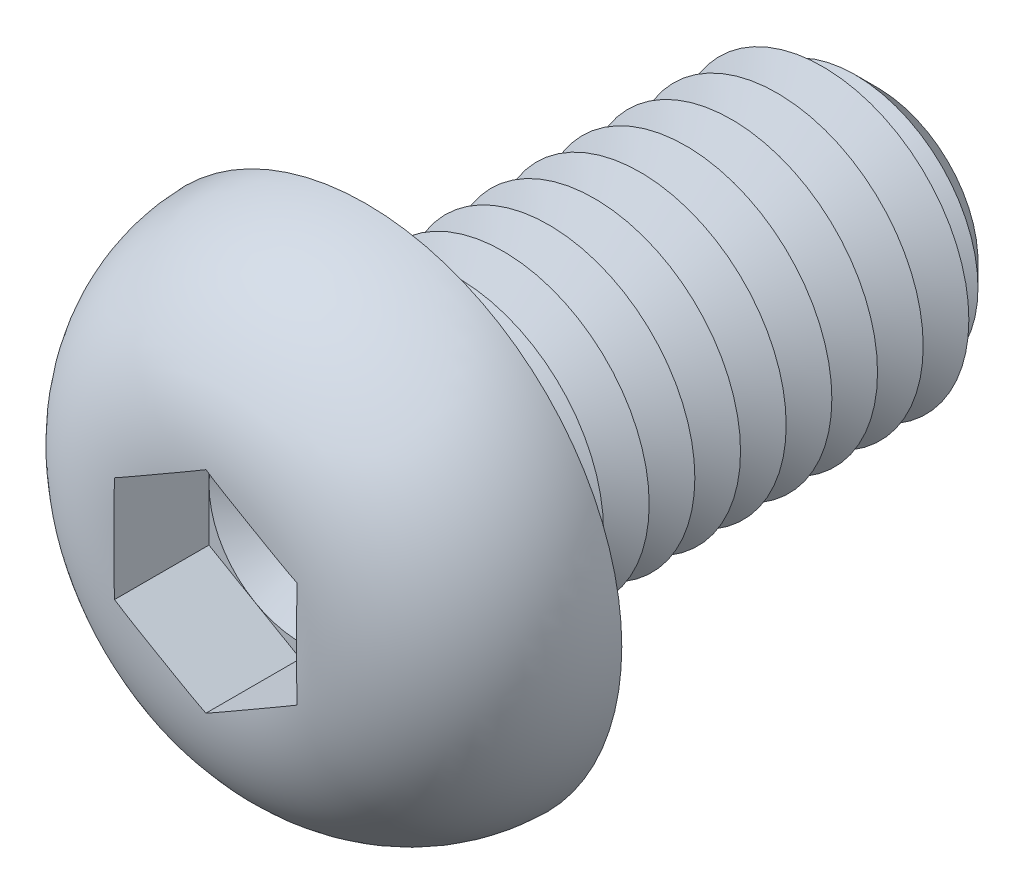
ISO-10303-21;
HEADER;
FILE_DESCRIPTION(('STEP AP214'),'2;1');
FILE_NAME('part.step','',(''),(''),'','','');
FILE_SCHEMA(('AUTOMOTIVE_DESIGN { 1 0 10303 214 1 1 1 1 }'));
ENDSEC;
DATA;
#1=APPLICATION_CONTEXT('core data for automotive mechanical design processes');
#2=APPLICATION_PROTOCOL_DEFINITION('international standard','automotive_design',2000,#1);
#3=PRODUCT_CONTEXT('',#1,'mechanical');
#4=PRODUCT('Part','Part','',(#3));
#5=PRODUCT_RELATED_PRODUCT_CATEGORY('part','',(#4));
#6=PRODUCT_DEFINITION_FORMATION('','',#4);
#7=PRODUCT_DEFINITION_CONTEXT('part definition',#1,'design');
#8=PRODUCT_DEFINITION('design','',#6,#7);
#9=PRODUCT_DEFINITION_SHAPE('','',#8);
#10=(LENGTH_UNIT() NAMED_UNIT(*) SI_UNIT(.MILLI.,.METRE.));
#11=(NAMED_UNIT(*) PLANE_ANGLE_UNIT() SI_UNIT($,.RADIAN.));
#12=(NAMED_UNIT(*) SI_UNIT($,.STERADIAN.) SOLID_ANGLE_UNIT());
#13=UNCERTAINTY_MEASURE_WITH_UNIT(LENGTH_MEASURE(1.E-05),#10,'distance_accuracy_value','');
#14=(GEOMETRIC_REPRESENTATION_CONTEXT(3) GLOBAL_UNCERTAINTY_ASSIGNED_CONTEXT((#13)) GLOBAL_UNIT_ASSIGNED_CONTEXT((#10,
#11,#12)) REPRESENTATION_CONTEXT('',''));
#15=CARTESIAN_POINT('',(0.,0.,0.));
#16=DIRECTION('',(0.,0.,1.));
#17=DIRECTION('',(1.,0.,0.));
#18=AXIS2_PLACEMENT_3D('',#15,#16,#17);
#19=CARTESIAN_POINT('',(0.,0.,1.8));
#20=DIRECTION('',(0.,0.,1.));
#21=DIRECTION('',(1.,0.,0.));
#22=AXIS2_PLACEMENT_3D('',#19,#20,#21);
#23=PLANE('',#22);
#24=CARTESIAN_POINT('',(0.,0.,1.8));
#25=DIRECTION('',(0.,0.,1.));
#26=DIRECTION('',(1.,0.,0.));
#27=AXIS2_PLACEMENT_3D('',#24,#25,#26);
#28=CIRCLE('',#27,2.5);
#29=CARTESIAN_POINT('',(2.5,0.,1.8));
#30=VERTEX_POINT('',#29);
#31=CARTESIAN_POINT('',(1.25,2.1650635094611,1.8));
#32=VERTEX_POINT('',#31);
#33=EDGE_CURVE('E153',#30,#32,#28,.T.);
#34=ORIENTED_EDGE('',*,*,#33,.F.);
#35=DIRECTION('',(0.,1.,0.));
#36=VECTOR('',#35,1.);
#37=CARTESIAN_POINT('',(2.5,-1.44337567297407,1.8));
#38=LINE('',#37,#36);
#39=CARTESIAN_POINT('',(2.5,1.44337567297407,1.8));
#40=VERTEX_POINT('',#39);
#41=EDGE_CURVE('E176',#30,#40,#38,.T.);
#42=ORIENTED_EDGE('',*,*,#41,.T.);
#43=DIRECTION('',(-0.866025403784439,0.5,0.));
#44=VECTOR('',#43,1.);
#45=CARTESIAN_POINT('',(2.5,1.44337567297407,1.8));
#46=LINE('',#45,#44);
#47=EDGE_CURVE('E172',#40,#32,#46,.T.);
#48=ORIENTED_EDGE('',*,*,#47,.T.);
#49=EDGE_LOOP('',(#34,#42,#48));
#50=FACE_BOUND('',#49,.T.);
#51=ADVANCED_FACE('F39',(#50),#23,.T.);
#52=CARTESIAN_POINT('',(0.,0.,1.8));
#53=DIRECTION('',(0.,0.,1.));
#54=DIRECTION('',(1.,0.,0.));
#55=AXIS2_PLACEMENT_3D('',#52,#53,#54);
#56=CIRCLE('',#55,2.5);
#57=CARTESIAN_POINT('',(-1.25,2.1650635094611,1.8));
#58=VERTEX_POINT('',#57);
#59=EDGE_CURVE('E11',#32,#58,#56,.T.);
#60=ORIENTED_EDGE('',*,*,#59,.F.);
#61=CARTESIAN_POINT('',(0.,2.88675134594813,1.8));
#62=VERTEX_POINT('',#61);
#63=EDGE_CURVE('E166',#32,#62,#46,.T.);
#64=ORIENTED_EDGE('',*,*,#63,.T.);
#65=DIRECTION('',(-0.866025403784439,-0.5,0.));
#66=VECTOR('',#65,1.);
#67=CARTESIAN_POINT('',(0.,2.88675134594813,1.8));
#68=LINE('',#67,#66);
#69=EDGE_CURVE('E167',#62,#58,#68,.T.);
#70=ORIENTED_EDGE('',*,*,#69,.T.);
#71=EDGE_LOOP('',(#60,#64,#70));
#72=FACE_BOUND('',#71,.T.);
#73=ADVANCED_FACE('F165',(#72),#23,.T.);
#74=CARTESIAN_POINT('',(-2.5,0.,1.8));
#75=VERTEX_POINT('',#74);
#76=EDGE_CURVE('E49',#58,#75,#56,.T.);
#77=ORIENTED_EDGE('',*,*,#76,.F.);
#78=CARTESIAN_POINT('',(-2.5,1.44337567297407,1.8));
#79=VERTEX_POINT('',#78);
#80=EDGE_CURVE('E179',#58,#79,#68,.T.);
#81=ORIENTED_EDGE('',*,*,#80,.T.);
#82=DIRECTION('',(0.,-1.,0.));
#83=VECTOR('',#82,1.);
#84=CARTESIAN_POINT('',(-2.5,1.44337567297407,1.8));
#85=LINE('',#84,#83);
#86=EDGE_CURVE('E190',#79,#75,#85,.T.);
#87=ORIENTED_EDGE('',*,*,#86,.T.);
#88=EDGE_LOOP('',(#77,#81,#87));
#89=FACE_BOUND('',#88,.T.);
#90=ADVANCED_FACE('F444',(#89),#23,.T.);
#91=CARTESIAN_POINT('',(-1.25,-2.1650635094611,1.8));
#92=VERTEX_POINT('',#91);
#93=EDGE_CURVE('E429',#75,#92,#56,.T.);
#94=ORIENTED_EDGE('',*,*,#93,.F.);
#95=CARTESIAN_POINT('',(-2.5,-1.44337567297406,1.8));
#96=VERTEX_POINT('',#95);
#97=EDGE_CURVE('E189',#75,#96,#85,.T.);
#98=ORIENTED_EDGE('',*,*,#97,.T.);
#99=DIRECTION('',(0.866025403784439,-0.5,0.));
#100=VECTOR('',#99,1.);
#101=CARTESIAN_POINT('',(-2.5,-1.44337567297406,1.8));
#102=LINE('',#101,#100);
#103=EDGE_CURVE('E195',#96,#92,#102,.T.);
#104=ORIENTED_EDGE('',*,*,#103,.T.);
#105=EDGE_LOOP('',(#94,#98,#104));
#106=FACE_BOUND('',#105,.T.);
#107=ADVANCED_FACE('F438',(#106),#23,.T.);
#108=CARTESIAN_POINT('',(1.25,-2.1650635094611,1.8));
#109=VERTEX_POINT('',#108);
#110=EDGE_CURVE('E56',#92,#109,#56,.T.);
#111=ORIENTED_EDGE('',*,*,#110,.F.);
#112=CARTESIAN_POINT('',(0.,-2.88675134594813,1.8));
#113=VERTEX_POINT('',#112);
#114=EDGE_CURVE('E194',#92,#113,#102,.T.);
#115=ORIENTED_EDGE('',*,*,#114,.T.);
#116=DIRECTION('',(0.866025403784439,0.5,0.));
#117=VECTOR('',#116,1.);
#118=CARTESIAN_POINT('',(0.,-2.88675134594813,1.8));
#119=LINE('',#118,#117);
#120=EDGE_CURVE('E200',#113,#109,#119,.T.);
#121=ORIENTED_EDGE('',*,*,#120,.T.);
#122=EDGE_LOOP('',(#111,#115,#121));
#123=FACE_BOUND('',#122,.T.);
#124=ADVANCED_FACE('F477',(#123),#23,.T.);
#125=CARTESIAN_POINT('',(0.,0.,-14.));
#126=DIRECTION('',(0.,0.,1.));
#127=DIRECTION('',(1.,0.,0.));
#128=AXIS2_PLACEMENT_3D('',#125,#126,#127);
#129=CYLINDRICAL_SURFACE('',#128,4.);
#130=CARTESIAN_POINT('',(0.,0.,-0.5));
#131=DIRECTION('',(0.,0.,1.));
#132=DIRECTION('',(1.,0.,0.));
#133=AXIS2_PLACEMENT_3D('',#130,#131,#132);
#134=CIRCLE('',#133,4.);
#135=CARTESIAN_POINT('',(4.,0.,-0.5));
#136=VERTEX_POINT('',#135);
#137=EDGE_CURVE('E411',#136,#136,#134,.F.);
#138=ORIENTED_EDGE('',*,*,#137,.T.);
#139=EDGE_LOOP('',(#138));
#140=FACE_BOUND('',#139,.T.);
#141=CARTESIAN_POINT('',(0.,0.,-1.25));
#142=DIRECTION('',(0.,0.,1.));
#143=DIRECTION('',(1.,0.,0.));
#144=AXIS2_PLACEMENT_3D('',#141,#142,#143);
#145=CIRCLE('',#144,4.00000000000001);
#146=CARTESIAN_POINT('',(4.00000000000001,0.,-1.25));
#147=VERTEX_POINT('',#146);
#148=EDGE_CURVE('E185',#147,#147,#145,.T.);
#149=ORIENTED_EDGE('',*,*,#148,.T.);
#150=EDGE_LOOP('',(#149));
#151=FACE_BOUND('',#150,.T.);
#152=ADVANCED_FACE('F472',(#140,#151),#129,.T.);
#153=CARTESIAN_POINT('',(0.,7.,0.));
#154=DIRECTION('',(0.,0.,1.));
#155=DIRECTION('',(1.,0.,0.));
#156=AXIS2_PLACEMENT_3D('',#153,#154,#155);
#157=PLANE('',#156);
#158=CARTESIAN_POINT('',(0.,0.,0.));
#159=DIRECTION('',(0.,0.,1.));
#160=DIRECTION('',(1.,0.,0.));
#161=AXIS2_PLACEMENT_3D('',#158,#159,#160);
#162=CIRCLE('',#161,4.5);
#163=CARTESIAN_POINT('',(4.5,0.,0.));
#164=VERTEX_POINT('',#163);
#165=EDGE_CURVE('E420',#164,#164,#162,.T.);
#166=ORIENTED_EDGE('',*,*,#165,.T.);
#167=EDGE_LOOP('',(#166));
#168=FACE_BOUND('',#167,.T.);
#169=CARTESIAN_POINT('',(0.,0.,0.));
#170=DIRECTION('',(0.,0.,1.));
#171=DIRECTION('',(1.,0.,0.));
#172=AXIS2_PLACEMENT_3D('',#169,#170,#171);
#173=CIRCLE('',#172,7.);
#174=CARTESIAN_POINT('',(7.,0.,0.));
#175=VERTEX_POINT('',#174);
#176=EDGE_CURVE('E211',#175,#175,#173,.T.);
#177=ORIENTED_EDGE('',*,*,#176,.F.);
#178=EDGE_LOOP('',(#177));
#179=FACE_BOUND('',#178,.T.);
#180=ADVANCED_FACE('F470',(#168,#179),#157,.F.);
#181=CARTESIAN_POINT('',(0.,0.,-0.1));
#182=DIRECTION('',(0.,0.,1.));
#183=DIRECTION('',(1.,0.,0.));
#184=AXIS2_PLACEMENT_3D('',#181,#182,#183);
#185=DEGENERATE_TOROIDAL_SURFACE('',#184,2.5011112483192,4.5,.T.);
#186=CARTESIAN_POINT('',(1.31456088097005,2.12778926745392,4.4));
#187=DIRECTION('',(-0.866025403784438,0.500000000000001,0.));
#188=VECTOR('',#187,1.);
#189=LINE('',#186,#188);
#190=CARTESIAN_POINT('',(1.31456088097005,2.12778926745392,4.4));
#191=VERTEX_POINT('',#190);
#192=CARTESIAN_POINT('',(1.18543911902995,2.20233775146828,4.4));
#193=VERTEX_POINT('',#192);
#194=EDGE_CURVE('E399',#191,#193,#189,.T.);
#195=ORIENTED_EDGE('',*,*,#194,.F.);
#196=CARTESIAN_POINT('',(-0.000200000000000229,2.88686681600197,4.38343536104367));
#197=CARTESIAN_POINT('',(0.103935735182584,2.82674402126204,4.38859262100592));
#198=CARTESIAN_POINT('',(0.208111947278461,2.76659785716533,4.39207570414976));
#199=CARTESIAN_POINT('',(0.416486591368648,2.64629270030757,4.39683754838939));
#200=CARTESIAN_POINT('',(0.520685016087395,2.58613371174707,4.39811670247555));
#201=CARTESIAN_POINT('',(0.729066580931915,2.46582455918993,4.3996156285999));
#202=CARTESIAN_POINT('',(0.833249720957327,2.40567439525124,4.39983556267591));
#203=CARTESIAN_POINT('',(1.04162190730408,2.2853706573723,4.4000276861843));
#204=CARTESIAN_POINT('',(1.14581095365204,2.2252170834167,4.39999986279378));
#205=CARTESIAN_POINT('',(1.35418904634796,2.10490993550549,4.39999986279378));
#206=CARTESIAN_POINT('',(1.45837809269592,2.04475636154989,4.4000276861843));
#207=CARTESIAN_POINT('',(1.66675027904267,1.92445262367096,4.39983556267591));
#208=CARTESIAN_POINT('',(1.77093341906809,1.86430245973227,4.3996156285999));
#209=CARTESIAN_POINT('',(1.97931498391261,1.74399330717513,4.39811670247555));
#210=CARTESIAN_POINT('',(2.08351340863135,1.68383431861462,4.39683754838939));
#211=CARTESIAN_POINT('',(2.29188805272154,1.56352916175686,4.39207570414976));
#212=CARTESIAN_POINT('',(2.39606426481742,1.50338299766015,4.38859262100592));
#213=CARTESIAN_POINT('',(2.5002,1.44326020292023,4.38343536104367));
#214=B_SPLINE_CURVE_WITH_KNOTS('',3,(#196,#197,#198,#199,#200,#201,#202,#203,#204,#205,#206,
#207,#208,#209,#210,#211,#212,#213),.UNSPECIFIED.,.F.,.F.,(4,2,2,2,2,2,2,2,4),(0.,
0.361022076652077,0.721979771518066,1.08288224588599,1.44380339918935,1.80472455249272,
2.16562702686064,2.52658472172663,2.88760679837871),.UNSPECIFIED.);
#215=CARTESIAN_POINT('',(2.5,1.44337567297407,4.38344529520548));
#216=VERTEX_POINT('',#215);
#217=EDGE_CURVE('E355',#191,#216,#214,.T.);
#218=ORIENTED_EDGE('',*,*,#217,.T.);
#219=CARTESIAN_POINT('',(2.5,0.,4.39999986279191));
#220=CARTESIAN_POINT('',(2.5,-0.104697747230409,4.39999811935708));
#221=CARTESIAN_POINT('',(2.5,-0.209395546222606,4.40001551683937));
#222=CARTESIAN_POINT('',(2.5,-0.418792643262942,4.39990807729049));
#223=CARTESIAN_POINT('',(2.5,-0.52349194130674,4.39978323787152));
#224=CARTESIAN_POINT('',(2.5,-0.732936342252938,4.39891238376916));
#225=CARTESIAN_POINT('',(2.5,-0.837681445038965,4.39816609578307));
#226=CARTESIAN_POINT('',(2.5,-1.04715282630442,4.39536239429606));
#227=CARTESIAN_POINT('',(2.5,-1.15187910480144,4.39330498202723));
#228=CARTESIAN_POINT('',(2.5,-1.46476484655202,4.38400647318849));
#229=CARTESIAN_POINT('',(2.5,-1.67286375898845,4.37365196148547));
#230=CARTESIAN_POINT('',(2.5,-2.08783281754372,4.33852954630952));
#231=CARTESIAN_POINT('',(2.5,-2.29470379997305,4.31377296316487));
#232=CARTESIAN_POINT('',(2.5,-2.64451002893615,4.25536510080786));
#233=CARTESIAN_POINT('',(2.5,-2.78823975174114,4.22651785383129));
#234=CARTESIAN_POINT('',(2.5,-3.073224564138,4.15827060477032));
#235=CARTESIAN_POINT('',(2.5,-3.21447933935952,4.11886927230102));
#236=CARTESIAN_POINT('',(2.5,-3.49353952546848,4.02870287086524));
#237=CARTESIAN_POINT('',(2.5,-3.6313402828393,3.97792330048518));
#238=CARTESIAN_POINT('',(2.5,-3.90204977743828,3.86463774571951));
#239=CARTESIAN_POINT('',(2.5,-4.0349587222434,3.8021322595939));
#240=CARTESIAN_POINT('',(2.5,-4.2956525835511,3.66474880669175));
#241=CARTESIAN_POINT('',(2.5,-4.42338586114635,3.58977252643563));
#242=CARTESIAN_POINT('',(2.5,-4.67118559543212,3.42803136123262));
#243=CARTESIAN_POINT('',(2.5,-4.79125159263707,3.3412657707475));
#244=CARTESIAN_POINT('',(2.5,-5.02233156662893,3.15645800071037));
#245=CARTESIAN_POINT('',(2.5,-5.13334771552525,3.05841854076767));
#246=CARTESIAN_POINT('',(2.5,-5.34506083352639,2.85177471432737));
#247=CARTESIAN_POINT('',(2.5,-5.44575933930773,2.74317192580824));
#248=CARTESIAN_POINT('',(2.5,-5.62335564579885,2.53102225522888));
#249=CARTESIAN_POINT('',(2.5,-5.70164721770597,2.42863868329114));
#250=CARTESIAN_POINT('',(2.5,-5.84882394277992,2.21725758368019));
#251=CARTESIAN_POINT('',(2.5,-5.91770588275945,2.10825781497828));
#252=CARTESIAN_POINT('',(2.5,-6.04532926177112,1.88460009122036));
#253=CARTESIAN_POINT('',(2.5,-6.1040794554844,1.76994713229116));
#254=CARTESIAN_POINT('',(2.5,-6.21098181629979,1.53574793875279));
#255=CARTESIAN_POINT('',(2.5,-6.25913021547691,1.41619998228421));
#256=CARTESIAN_POINT('',(2.5,-6.34173830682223,1.18065209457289));
#257=CARTESIAN_POINT('',(2.5,-6.37685491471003,1.06488207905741));
#258=CARTESIAN_POINT('',(2.5,-6.43703913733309,0.830714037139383));
#259=CARTESIAN_POINT('',(2.5,-6.46210319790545,0.712315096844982));
#260=CARTESIAN_POINT('',(2.5,-6.50194044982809,0.473848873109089));
#261=CARTESIAN_POINT('',(2.5,-6.51671856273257,0.353782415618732));
#262=CARTESIAN_POINT('',(2.5,-6.53588982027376,0.112808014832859));
#263=CARTESIAN_POINT('',(2.5,-6.54027911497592,-0.00810022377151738));
#264=CARTESIAN_POINT('',(2.5,-6.53779027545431,-0.365870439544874));
#265=CARTESIAN_POINT('',(2.5,-6.51607942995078,-0.602790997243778));
#266=CARTESIAN_POINT('',(2.5,-6.43310265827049,-1.06957107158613));
#267=CARTESIAN_POINT('',(2.5,-6.3718398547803,-1.29943114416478));
#268=CARTESIAN_POINT('',(2.5,-6.25195024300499,-1.63390601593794));
#269=CARTESIAN_POINT('',(2.5,-6.20730237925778,-1.74371189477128));
#270=CARTESIAN_POINT('',(2.5,-6.10902350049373,-1.95921136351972));
#271=CARTESIAN_POINT('',(2.5,-6.05539567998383,-2.06490639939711));
#272=CARTESIAN_POINT('',(2.5,-5.93955620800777,-2.27152527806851));
#273=CARTESIAN_POINT('',(2.5,-5.87734126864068,-2.37244727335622));
#274=CARTESIAN_POINT('',(2.5,-5.7448545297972,-2.56880727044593));
#275=CARTESIAN_POINT('',(2.5,-5.67458537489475,-2.6642470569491));
#276=CARTESIAN_POINT('',(2.5,-5.52523018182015,-2.85070592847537));
#277=CARTESIAN_POINT('',(2.5,-5.44601185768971,-2.94161901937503));
#278=CARTESIAN_POINT('',(2.5,-5.28044044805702,-3.11663859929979));
#279=CARTESIAN_POINT('',(2.5,-5.194089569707,-3.2007471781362));
#280=CARTESIAN_POINT('',(2.5,-5.01485870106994,-3.36178408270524));
#281=CARTESIAN_POINT('',(2.5,-4.92197538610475,-3.43870870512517));
#282=CARTESIAN_POINT('',(2.5,-4.73045535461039,-3.58495812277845));
#283=CARTESIAN_POINT('',(2.5,-4.6318202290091,-3.65428500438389));
#284=CARTESIAN_POINT('',(2.5,-4.4247626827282,-3.78818551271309));
#285=CARTESIAN_POINT('',(2.5,-4.31609824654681,-3.85238474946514));
#286=CARTESIAN_POINT('',(2.5,-4.0940582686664,-3.97208975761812));
#287=CARTESIAN_POINT('',(2.5,-3.98068153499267,-4.02759331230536));
#288=CARTESIAN_POINT('',(2.5,-3.75029026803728,-4.12981004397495));
#289=CARTESIAN_POINT('',(2.5,-3.63328275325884,-4.17653908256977));
#290=CARTESIAN_POINT('',(2.5,-3.39631992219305,-4.2614893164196));
#291=CARTESIAN_POINT('',(2.5,-3.27636651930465,-4.29971587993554));
#292=CARTESIAN_POINT('',(2.5,-3.00446622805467,-4.37644925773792));
#293=CARTESIAN_POINT('',(2.5,-2.85188931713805,-4.41272455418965));
#294=CARTESIAN_POINT('',(2.5,-2.54443794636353,-4.47385449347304));
#295=CARTESIAN_POINT('',(2.5,-2.3895624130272,-4.49870361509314));
#296=CARTESIAN_POINT('',(2.5,-2.07807451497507,-4.53870829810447));
#297=CARTESIAN_POINT('',(2.5,-1.92145805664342,-4.55383091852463));
#298=CARTESIAN_POINT('',(2.5,-1.60772330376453,-4.57647936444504));
#299=CARTESIAN_POINT('',(2.5,-1.45060502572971,-4.58400543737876));
#300=CARTESIAN_POINT('',(2.5,-1.13432460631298,-4.59416656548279));
#301=CARTESIAN_POINT('',(2.5,-0.975160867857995,-4.59674096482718));
#302=CARTESIAN_POINT('',(2.5,-0.656826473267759,-4.59957813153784));
#303=CARTESIAN_POINT('',(2.5,-0.497655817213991,-4.59984092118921));
#304=CARTESIAN_POINT('',(2.5,-0.179547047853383,-4.60005428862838));
#305=CARTESIAN_POINT('',(2.5,-0.02060893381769,-4.60000532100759));
#306=CARTESIAN_POINT('',(2.5,0.297265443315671,-4.59999304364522));
#307=CARTESIAN_POINT('',(2.5,0.456201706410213,-4.60002973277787));
#308=CARTESIAN_POINT('',(2.5,0.70967559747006,-4.59902611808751));
#309=CARTESIAN_POINT('',(2.5,0.804213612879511,-4.59841616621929));
#310=CARTESIAN_POINT('',(2.5,0.99327694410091,-4.59620676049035));
#311=CARTESIAN_POINT('',(2.5,1.08780225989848,-4.59460730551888));
#312=CARTESIAN_POINT('',(2.5,1.37137837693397,-4.58746770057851));
#313=CARTESIAN_POINT('',(2.5,1.56039301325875,-4.57958602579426));
#314=CARTESIAN_POINT('',(2.5,1.93609462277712,-4.55305686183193));
#315=CARTESIAN_POINT('',(2.5,2.12278756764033,-4.53450331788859));
#316=CARTESIAN_POINT('',(2.5,2.49421016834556,-4.48296248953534));
#317=CARTESIAN_POINT('',(2.5,2.67894050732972,-4.44998040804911));
#318=CARTESIAN_POINT('',(2.5,2.99962701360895,-4.37718406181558));
#319=CARTESIAN_POINT('',(2.5,3.13641465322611,-4.34103978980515));
#320=CARTESIAN_POINT('',(2.5,3.40682838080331,-4.25834226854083));
#321=CARTESIAN_POINT('',(2.5,3.54045461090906,-4.21178948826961));
#322=CARTESIAN_POINT('',(2.5,3.80387940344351,-4.1076796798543));
#323=CARTESIAN_POINT('',(2.5,3.93366385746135,-4.05008679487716));
#324=CARTESIAN_POINT('',(2.5,4.18776789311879,-3.92385886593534));
#325=CARTESIAN_POINT('',(2.5,4.31208736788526,-3.85522360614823));
#326=CARTESIAN_POINT('',(2.5,4.55475418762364,-3.70660227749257));
#327=CARTESIAN_POINT('',(2.5,4.67306276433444,-3.62655275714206));
#328=CARTESIAN_POINT('',(2.5,4.90171316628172,-3.45576294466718));
#329=CARTESIAN_POINT('',(2.5,5.01205476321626,-3.36502234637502));
#330=CARTESIAN_POINT('',(2.5,5.22347091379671,-3.17353376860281));
#331=CARTESIAN_POINT('',(2.5,5.32455555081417,-3.07279693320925));
#332=CARTESIAN_POINT('',(2.5,5.51647993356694,-2.86200023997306));
#333=CARTESIAN_POINT('',(2.5,5.6073208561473,-2.75194145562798));
#334=CARTESIAN_POINT('',(2.5,5.76832451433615,-2.53607083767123));
#335=CARTESIAN_POINT('',(2.5,5.83966300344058,-2.4311337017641));
#336=CARTESIAN_POINT('',(2.5,5.97282702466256,-2.2153291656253));
#337=CARTESIAN_POINT('',(2.5,6.03464926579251,-2.10445973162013));
#338=CARTESIAN_POINT('',(2.5,6.14815657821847,-1.87771731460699));
#339=CARTESIAN_POINT('',(2.5,6.19984675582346,-1.76184688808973));
#340=CARTESIAN_POINT('',(2.5,6.29267395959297,-1.52590109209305));
#341=CARTESIAN_POINT('',(2.5,6.33380720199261,-1.40582423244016));
#342=CARTESIAN_POINT('',(2.5,6.40328888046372,-1.16869740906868));
#343=CARTESIAN_POINT('',(2.5,6.43218419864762,-1.05180738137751));
#344=CARTESIAN_POINT('',(2.5,6.47988151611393,-0.815941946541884));
#345=CARTESIAN_POINT('',(2.5,6.49867991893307,-0.696965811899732));
#346=CARTESIAN_POINT('',(2.5,6.52599950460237,-0.457898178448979));
#347=CARTESIAN_POINT('',(2.5,6.53452634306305,-0.337807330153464));
#348=CARTESIAN_POINT('',(2.5,6.54126106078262,-0.0973214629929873));
#349=CARTESIAN_POINT('',(2.5,6.5394651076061,0.023073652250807));
#350=CARTESIAN_POINT('',(2.5,6.51879545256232,0.379398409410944));
#351=CARTESIAN_POINT('',(2.5,6.48510560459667,0.614630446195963));
#352=CARTESIAN_POINT('',(2.5,6.37872360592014,1.07608887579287));
#353=CARTESIAN_POINT('',(2.5,6.30603128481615,1.3023152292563));
#354=CARTESIAN_POINT('',(2.5,6.16957161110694,1.63028303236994));
#355=CARTESIAN_POINT('',(2.5,6.11941470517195,1.7378698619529));
#356=CARTESIAN_POINT('',(2.5,6.01034124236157,1.94849153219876));
#357=CARTESIAN_POINT('',(2.5,5.9514277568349,2.05152795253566));
#358=CARTESIAN_POINT('',(2.5,5.82528890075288,2.25240256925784));
#359=CARTESIAN_POINT('',(2.5,5.75806159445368,2.35023954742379));
#360=CARTESIAN_POINT('',(2.5,5.61585543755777,2.54005689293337));
#361=CARTESIAN_POINT('',(2.5,5.54087908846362,2.63203913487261));
#362=CARTESIAN_POINT('',(2.5,5.38212190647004,2.81146438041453));
#363=CARTESIAN_POINT('',(2.5,5.29819182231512,2.89877528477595));
#364=CARTESIAN_POINT('',(2.5,5.12353712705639,3.06625194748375));
#365=CARTESIAN_POINT('',(2.5,5.03281455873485,3.14641983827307));
#366=CARTESIAN_POINT('',(2.5,4.84518171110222,3.29930665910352));
#367=CARTESIAN_POINT('',(2.5,4.74826657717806,3.37201962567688));
#368=CARTESIAN_POINT('',(2.5,4.54907485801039,3.50961479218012));
#369=CARTESIAN_POINT('',(2.5,4.44679969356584,3.57449905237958));
#370=CARTESIAN_POINT('',(2.5,4.23202545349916,3.69953578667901));
#371=CARTESIAN_POINT('',(2.5,4.11927203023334,3.75925114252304));
#372=CARTESIAN_POINT('',(2.5,3.88947986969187,3.86977617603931));
#373=CARTESIAN_POINT('',(2.5,3.77244067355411,3.92058489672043));
#374=CARTESIAN_POINT('',(2.5,3.5351804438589,4.0133148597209));
#375=CARTESIAN_POINT('',(2.5,3.41496637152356,4.0552539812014));
#376=CARTESIAN_POINT('',(2.5,3.17195278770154,4.13067246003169));
#377=CARTESIAN_POINT('',(2.5,3.04915378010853,4.16415344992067));
#378=CARTESIAN_POINT('',(2.5,2.80683027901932,4.22194717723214));
#379=CARTESIAN_POINT('',(2.5,2.68738216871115,4.2465834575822));
#380=CARTESIAN_POINT('',(2.5,2.44729214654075,4.28920746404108));
#381=CARTESIAN_POINT('',(2.5,2.32664997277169,4.30719369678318));
#382=CARTESIAN_POINT('',(2.5,2.08450864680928,4.33736171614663));
#383=CARTESIAN_POINT('',(2.5,1.9630086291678,4.3495363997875));
#384=CARTESIAN_POINT('',(2.5,1.71961501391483,4.36908103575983));
#385=CARTESIAN_POINT('',(2.5,1.59772134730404,4.37645009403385));
#386=CARTESIAN_POINT('',(2.5,1.35283283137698,4.38761579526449));
#387=CARTESIAN_POINT('',(2.5,1.22983679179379,4.39138420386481));
#388=CARTESIAN_POINT('',(2.5,0.983808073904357,4.3965493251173));
#389=CARTESIAN_POINT('',(2.5,0.860775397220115,4.3979461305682));
#390=CARTESIAN_POINT('',(2.5,0.614783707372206,4.39958107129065));
#391=CARTESIAN_POINT('',(2.5,0.491824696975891,4.3998199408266));
#392=CARTESIAN_POINT('',(2.5,0.245910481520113,4.40003035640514));
#393=CARTESIAN_POINT('',(2.5,0.122955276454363,4.4000019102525));
#394=CARTESIAN_POINT('',(2.5,0.,4.39999986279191));
#395=B_SPLINE_CURVE_WITH_KNOTS('',3,(#219,#220,#221,#222,#223,#224,#225,#226,#227,#228,#229,
#230,#231,#232,#233,#234,#235,#236,#237,#238,#239,#240,#241,#242,#243,#244,#245,#246,#247,#248,
#249,#250,#251,#252,#253,#254,#255,#256,#257,#258,#259,#260,#261,#262,#263,#264,#265,#266,#267,
#268,#269,#270,#271,#272,#273,#274,#275,#276,#277,#278,#279,#280,#281,#282,#283,#284,#285,#286,
#287,#288,#289,#290,#291,#292,#293,#294,#295,#296,#297,#298,#299,#300,#301,#302,#303,#304,#305,
#306,#307,#308,#309,#310,#311,#312,#313,#314,#315,#316,#317,#318,#319,#320,#321,#322,#323,#324,
#325,#326,#327,#328,#329,#330,#331,#332,#333,#334,#335,#336,#337,#338,#339,#340,#341,#342,#343,
#344,#345,#346,#347,#348,#349,#350,#351,#352,#353,#354,#355,#356,#357,#358,#359,#360,#361,#362,
#363,#364,#365,#366,#367,#368,#369,#370,#371,#372,#373,#374,#375,#376,#377,#378,#379,#380,#381,
#382,#383,#384,#385,#386,#387,#388,#389,#390,#391,#392,#393,#394),.UNSPECIFIED.,.T.,.F.,(4,2,2,
2,2,2,2,2,2,2,2,2,2,2,2,2,2,2,2,2,2,2,2,2,2,2,2,2,2,2,2,2,2,2,2,2,2,2,2,2,2,2,2,2,2,2,2,2,2,2,2,
2,2,2,2,2,2,2,2,2,2,2,2,2,2,2,2,2,2,2,2,2,2,2,2,2,2,2,2,2,2,2,2,2,2,2,2,4),(0.,
0.314093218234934,0.62819170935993,0.942428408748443,1.25666481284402,1.88144147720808,
2.50572771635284,2.94516878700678,3.38466527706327,3.82472511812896,4.26476626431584,
4.70845695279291,5.15217420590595,5.59578464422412,6.03932891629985,6.42549664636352,
6.81179591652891,7.19775970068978,7.58386043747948,7.94635637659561,8.30898036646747,
8.67143073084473,9.03401539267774,9.74414367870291,10.4542159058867,10.8094792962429,
11.1646165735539,11.5198902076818,11.8750475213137,12.2363927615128,12.597626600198,
12.9590456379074,13.3203651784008,13.698597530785,14.0769261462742,14.4545641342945,
14.8319630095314,15.3019396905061,15.7721432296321,16.2439309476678,16.715703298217,
17.1932187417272,17.6707295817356,18.1475442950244,18.6243527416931,18.9079682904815,
19.1915841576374,19.7589248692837,20.3213460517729,20.8835645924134,21.3076400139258,
21.731696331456,22.1571540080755,22.5826200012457,23.0105507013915,23.4384936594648,
23.8659647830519,24.2933867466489,24.6735755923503,25.0538956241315,25.4340234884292,
25.8142874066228,26.1750761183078,26.5359932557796,26.8967115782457,27.2575638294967,
27.9668653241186,28.6761699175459,29.0319382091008,29.3875820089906,29.7433087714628,
30.0989210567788,30.4618400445,30.8246503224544,31.1877485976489,31.5507511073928,
31.9331198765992,32.3155297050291,32.6971611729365,33.0787189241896,33.4443988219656,
33.8101607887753,34.1763686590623,34.54264464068,34.9117697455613,35.2808804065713,
35.6497569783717,36.0186227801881),.UNSPECIFIED.);
#396=CARTESIAN_POINT('',(2.5,0.0745484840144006,4.4));
#397=VERTEX_POINT('',#396);
#398=EDGE_CURVE('E345',#216,#397,#395,.T.);
#399=ORIENTED_EDGE('',*,*,#398,.T.);
#400=CARTESIAN_POINT('',(2.5,-0.0745484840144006,4.4));
#401=DIRECTION('',(0.,1.,0.));
#402=VECTOR('',#401,1.);
#403=LINE('',#400,#402);
#404=CARTESIAN_POINT('',(2.5,-0.0745484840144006,4.4));
#405=VERTEX_POINT('',#404);
#406=EDGE_CURVE('E174',#405,#397,#403,.T.);
#407=ORIENTED_EDGE('',*,*,#406,.F.);
#408=CARTESIAN_POINT('',(2.5,-1.44337567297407,4.38344529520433));
#409=VERTEX_POINT('',#408);
#410=EDGE_CURVE('E356',#405,#409,#395,.T.);
#411=ORIENTED_EDGE('',*,*,#410,.T.);
#412=CARTESIAN_POINT('',(2.5002,-1.44326020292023,4.38343536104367));
#413=CARTESIAN_POINT('',(2.39606426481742,-1.50338299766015,4.38859262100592));
#414=CARTESIAN_POINT('',(2.29188805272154,-1.56352916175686,4.39207570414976));
#415=CARTESIAN_POINT('',(2.08351340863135,-1.68383431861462,4.39683754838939));
#416=CARTESIAN_POINT('',(1.9793149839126,-1.74399330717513,4.39811670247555));
#417=CARTESIAN_POINT('',(1.77093341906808,-1.86430245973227,4.3996156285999));
#418=CARTESIAN_POINT('',(1.66675027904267,-1.92445262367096,4.39983556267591));
#419=CARTESIAN_POINT('',(1.45837809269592,-2.04475636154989,4.4000276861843));
#420=CARTESIAN_POINT('',(1.35418904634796,-2.10490993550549,4.39999986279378));
#421=CARTESIAN_POINT('',(1.14581095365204,-2.2252170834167,4.39999986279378));
#422=CARTESIAN_POINT('',(1.04162190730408,-2.2853706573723,4.4000276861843));
#423=CARTESIAN_POINT('',(0.833249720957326,-2.40567439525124,4.39983556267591));
#424=CARTESIAN_POINT('',(0.729066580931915,-2.46582455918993,4.3996156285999));
#425=CARTESIAN_POINT('',(0.520685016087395,-2.58613371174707,4.39811670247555));
#426=CARTESIAN_POINT('',(0.416486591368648,-2.64629270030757,4.39683754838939));
#427=CARTESIAN_POINT('',(0.208111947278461,-2.76659785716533,4.39207570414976));
#428=CARTESIAN_POINT('',(0.103935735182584,-2.82674402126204,4.38859262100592));
#429=CARTESIAN_POINT('',(-0.000200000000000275,-2.88686681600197,4.38343536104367));
#430=B_SPLINE_CURVE_WITH_KNOTS('',3,(#412,#413,#414,#415,#416,#417,#418,#419,#420,#421,#422,
#423,#424,#425,#426,#427,#428,#429),.UNSPECIFIED.,.F.,.F.,(4,2,2,2,2,2,2,2,4),(0.,
0.361022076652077,0.721979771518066,1.08288224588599,1.44380339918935,1.80472455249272,
2.16562702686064,2.52658472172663,2.88760679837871),.UNSPECIFIED.);
#431=CARTESIAN_POINT('',(1.31456088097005,-2.12778926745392,4.4));
#432=VERTEX_POINT('',#431);
#433=EDGE_CURVE('E332',#409,#432,#430,.T.);
#434=ORIENTED_EDGE('',*,*,#433,.T.);
#435=CARTESIAN_POINT('',(1.18543911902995,-2.20233775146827,4.4));
#436=DIRECTION('',(0.866025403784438,0.500000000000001,0.));
#437=VECTOR('',#436,1.);
#438=LINE('',#435,#437);
#439=CARTESIAN_POINT('',(1.18543911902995,-2.20233775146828,4.4));
#440=VERTEX_POINT('',#439);
#441=EDGE_CURVE('E341',#440,#432,#438,.T.);
#442=ORIENTED_EDGE('',*,*,#441,.F.);
#443=CARTESIAN_POINT('',(0.,-2.88675134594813,4.38344529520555));
#444=VERTEX_POINT('',#443);
#445=EDGE_CURVE('E295',#440,#444,#430,.T.);
#446=ORIENTED_EDGE('',*,*,#445,.T.);
#447=CARTESIAN_POINT('',(0.00019999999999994,-2.88686681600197,4.38343536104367));
#448=CARTESIAN_POINT('',(-0.103935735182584,-2.82674402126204,4.38859262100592));
#449=CARTESIAN_POINT('',(-0.208111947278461,-2.76659785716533,4.39207570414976));
#450=CARTESIAN_POINT('',(-0.416486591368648,-2.64629270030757,4.39683754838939));
#451=CARTESIAN_POINT('',(-0.520685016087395,-2.58613371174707,4.39811670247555));
#452=CARTESIAN_POINT('',(-0.729066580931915,-2.46582455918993,4.3996156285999));
#453=CARTESIAN_POINT('',(-0.833249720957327,-2.40567439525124,4.39983556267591));
#454=CARTESIAN_POINT('',(-1.04162190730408,-2.2853706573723,4.4000276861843));
#455=CARTESIAN_POINT('',(-1.14581095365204,-2.2252170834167,4.39999986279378));
#456=CARTESIAN_POINT('',(-1.35418904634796,-2.10490993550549,4.39999986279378));
#457=CARTESIAN_POINT('',(-1.45837809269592,-2.04475636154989,4.4000276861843));
#458=CARTESIAN_POINT('',(-1.66675027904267,-1.92445262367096,4.39983556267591));
#459=CARTESIAN_POINT('',(-1.77093341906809,-1.86430245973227,4.3996156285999));
#460=CARTESIAN_POINT('',(-1.97931498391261,-1.74399330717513,4.39811670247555));
#461=CARTESIAN_POINT('',(-2.08351340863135,-1.68383431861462,4.39683754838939));
#462=CARTESIAN_POINT('',(-2.29188805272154,-1.56352916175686,4.39207570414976));
#463=CARTESIAN_POINT('',(-2.39606426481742,-1.50338299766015,4.38859262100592));
#464=CARTESIAN_POINT('',(-2.5002,-1.44326020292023,4.38343536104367));
#465=B_SPLINE_CURVE_WITH_KNOTS('',3,(#447,#448,#449,#450,#451,#452,#453,#454,#455,#456,#457,
#458,#459,#460,#461,#462,#463,#464),.UNSPECIFIED.,.F.,.F.,(4,2,2,2,2,2,2,2,4),(0.,
0.361022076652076,0.721979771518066,1.08288224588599,1.44380339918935,1.80472455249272,
2.16562702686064,2.52658472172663,2.88760679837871),.UNSPECIFIED.);
#466=CARTESIAN_POINT('',(-1.18543911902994,-2.20233775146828,4.4));
#467=VERTEX_POINT('',#466);
#468=EDGE_CURVE('E285',#444,#467,#465,.T.);
#469=ORIENTED_EDGE('',*,*,#468,.T.);
#470=CARTESIAN_POINT('',(-1.31456088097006,-2.12778926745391,4.4));
#471=DIRECTION('',(0.86602540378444,-0.499999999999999,0.));
#472=VECTOR('',#471,1.);
#473=LINE('',#470,#472);
#474=CARTESIAN_POINT('',(-1.31456088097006,-2.12778926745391,4.4));
#475=VERTEX_POINT('',#474);
#476=EDGE_CURVE('E560',#475,#467,#473,.T.);
#477=ORIENTED_EDGE('',*,*,#476,.F.);
#478=CARTESIAN_POINT('',(-2.5,-1.44337567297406,4.38344529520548));
#479=VERTEX_POINT('',#478);
#480=EDGE_CURVE('E296',#475,#479,#465,.T.);
#481=ORIENTED_EDGE('',*,*,#480,.T.);
#482=CARTESIAN_POINT('',(-2.5,0.,4.39999986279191));
#483=CARTESIAN_POINT('',(-2.5,0.104697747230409,4.39999811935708));
#484=CARTESIAN_POINT('',(-2.5,0.209395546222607,4.40001551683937));
#485=CARTESIAN_POINT('',(-2.5,0.418792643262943,4.39990807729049));
#486=CARTESIAN_POINT('',(-2.5,0.523491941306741,4.39978323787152));
#487=CARTESIAN_POINT('',(-2.5,0.732936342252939,4.39891238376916));
#488=CARTESIAN_POINT('',(-2.5,0.837681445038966,4.39816609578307));
#489=CARTESIAN_POINT('',(-2.5,1.04715282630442,4.39536239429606));
#490=CARTESIAN_POINT('',(-2.5,1.15187910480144,4.39330498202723));
#491=CARTESIAN_POINT('',(-2.5,1.46476484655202,4.38400647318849));
#492=CARTESIAN_POINT('',(-2.5,1.67286375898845,4.37365196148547));
#493=CARTESIAN_POINT('',(-2.5,2.08783281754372,4.33852954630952));
#494=CARTESIAN_POINT('',(-2.5,2.29470379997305,4.31377296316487));
#495=CARTESIAN_POINT('',(-2.5,2.64451002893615,4.25536510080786));
#496=CARTESIAN_POINT('',(-2.5,2.78823975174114,4.22651785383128));
#497=CARTESIAN_POINT('',(-2.5,3.073224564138,4.15827060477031));
#498=CARTESIAN_POINT('',(-2.5,3.21447933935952,4.11886927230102));
#499=CARTESIAN_POINT('',(-2.5,3.49353952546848,4.02870287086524));
#500=CARTESIAN_POINT('',(-2.5,3.6313402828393,3.97792330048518));
#501=CARTESIAN_POINT('',(-2.5,3.90204977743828,3.8646377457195));
#502=CARTESIAN_POINT('',(-2.5,4.0349587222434,3.8021322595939));
#503=CARTESIAN_POINT('',(-2.5,4.2956525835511,3.66474880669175));
#504=CARTESIAN_POINT('',(-2.5,4.42338586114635,3.58977252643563));
#505=CARTESIAN_POINT('',(-2.5,4.67118559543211,3.42803136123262));
#506=CARTESIAN_POINT('',(-2.5,4.79125159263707,3.3412657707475));
#507=CARTESIAN_POINT('',(-2.5,5.02233156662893,3.15645800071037));
#508=CARTESIAN_POINT('',(-2.5,5.13334771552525,3.05841854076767));
#509=CARTESIAN_POINT('',(-2.5,5.34506083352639,2.85177471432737));
#510=CARTESIAN_POINT('',(-2.5,5.44575933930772,2.74317192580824));
#511=CARTESIAN_POINT('',(-2.5,5.62335564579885,2.53102225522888));
#512=CARTESIAN_POINT('',(-2.5,5.70164721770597,2.42863868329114));
#513=CARTESIAN_POINT('',(-2.5,5.84882394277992,2.21725758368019));
#514=CARTESIAN_POINT('',(-2.5,5.91770588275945,2.10825781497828));
#515=CARTESIAN_POINT('',(-2.5,6.04532926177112,1.88460009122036));
#516=CARTESIAN_POINT('',(-2.5,6.1040794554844,1.76994713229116));
#517=CARTESIAN_POINT('',(-2.5,6.21098181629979,1.53574793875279));
#518=CARTESIAN_POINT('',(-2.5,6.25913021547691,1.41619998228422));
#519=CARTESIAN_POINT('',(-2.5,6.34173830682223,1.18065209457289));
#520=CARTESIAN_POINT('',(-2.5,6.37685491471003,1.06488207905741));
#521=CARTESIAN_POINT('',(-2.5,6.43703913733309,0.830714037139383));
#522=CARTESIAN_POINT('',(-2.5,6.46210319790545,0.712315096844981));
#523=CARTESIAN_POINT('',(-2.5,6.50194044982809,0.473848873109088));
#524=CARTESIAN_POINT('',(-2.5,6.51671856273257,0.35378241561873));
#525=CARTESIAN_POINT('',(-2.5,6.53588982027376,0.112808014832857));
#526=CARTESIAN_POINT('',(-2.5,6.54027911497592,-0.00810022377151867));
#527=CARTESIAN_POINT('',(-2.5,6.53779027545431,-0.365870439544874));
#528=CARTESIAN_POINT('',(-2.5,6.51607942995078,-0.602790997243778));
#529=CARTESIAN_POINT('',(-2.5,6.43310265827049,-1.06957107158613));
#530=CARTESIAN_POINT('',(-2.5,6.3718398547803,-1.29943114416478));
#531=CARTESIAN_POINT('',(-2.5,6.25195024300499,-1.63390601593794));
#532=CARTESIAN_POINT('',(-2.5,6.20730237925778,-1.74371189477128));
#533=CARTESIAN_POINT('',(-2.5,6.10902350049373,-1.95921136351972));
#534=CARTESIAN_POINT('',(-2.5,6.05539567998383,-2.06490639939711));
#535=CARTESIAN_POINT('',(-2.5,5.93955620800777,-2.27152527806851));
#536=CARTESIAN_POINT('',(-2.5,5.87734126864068,-2.37244727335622));
#537=CARTESIAN_POINT('',(-2.5,5.7448545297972,-2.56880727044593));
#538=CARTESIAN_POINT('',(-2.5,5.67458537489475,-2.6642470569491));
#539=CARTESIAN_POINT('',(-2.5,5.52523018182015,-2.85070592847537));
#540=CARTESIAN_POINT('',(-2.5,5.44601185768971,-2.94161901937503));
#541=CARTESIAN_POINT('',(-2.5,5.28044044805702,-3.11663859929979));
#542=CARTESIAN_POINT('',(-2.5,5.194089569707,-3.2007471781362));
#543=CARTESIAN_POINT('',(-2.5,5.01485870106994,-3.36178408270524));
#544=CARTESIAN_POINT('',(-2.5,4.92197538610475,-3.43870870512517));
#545=CARTESIAN_POINT('',(-2.5,4.73045535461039,-3.58495812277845));
#546=CARTESIAN_POINT('',(-2.5,4.6318202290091,-3.65428500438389));
#547=CARTESIAN_POINT('',(-2.5,4.4247626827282,-3.78818551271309));
#548=CARTESIAN_POINT('',(-2.5,4.31609824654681,-3.85238474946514));
#549=CARTESIAN_POINT('',(-2.5,4.0940582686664,-3.97208975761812));
#550=CARTESIAN_POINT('',(-2.5,3.98068153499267,-4.02759331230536));
#551=CARTESIAN_POINT('',(-2.5,3.75029026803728,-4.12981004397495));
#552=CARTESIAN_POINT('',(-2.5,3.63328275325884,-4.17653908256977));
#553=CARTESIAN_POINT('',(-2.5,3.39631992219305,-4.2614893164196));
#554=CARTESIAN_POINT('',(-2.5,3.27636651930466,-4.29971587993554));
#555=CARTESIAN_POINT('',(-2.5,3.00446622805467,-4.37644925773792));
#556=CARTESIAN_POINT('',(-2.5,2.85188931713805,-4.41272455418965));
#557=CARTESIAN_POINT('',(-2.5,2.54443794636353,-4.47385449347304));
#558=CARTESIAN_POINT('',(-2.5,2.3895624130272,-4.49870361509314));
#559=CARTESIAN_POINT('',(-2.5,2.07807451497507,-4.53870829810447));
#560=CARTESIAN_POINT('',(-2.5,1.92145805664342,-4.55383091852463));
#561=CARTESIAN_POINT('',(-2.5,1.60772330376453,-4.57647936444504));
#562=CARTESIAN_POINT('',(-2.5,1.45060502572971,-4.58400543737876));
#563=CARTESIAN_POINT('',(-2.5,1.13432460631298,-4.59416656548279));
#564=CARTESIAN_POINT('',(-2.5,0.975160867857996,-4.59674096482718));
#565=CARTESIAN_POINT('',(-2.5,0.65682647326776,-4.59957813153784));
#566=CARTESIAN_POINT('',(-2.5,0.497655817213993,-4.59984092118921));
#567=CARTESIAN_POINT('',(-2.5,0.179547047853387,-4.60005428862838));
#568=CARTESIAN_POINT('',(-2.5,0.0206089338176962,-4.60000532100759));
#569=CARTESIAN_POINT('',(-2.5,-0.297265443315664,-4.59999304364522));
#570=CARTESIAN_POINT('',(-2.5,-0.456201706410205,-4.60002973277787));
#571=CARTESIAN_POINT('',(-2.5,-0.709675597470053,-4.59902611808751));
#572=CARTESIAN_POINT('',(-2.5,-0.804213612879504,-4.59841616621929));
#573=CARTESIAN_POINT('',(-2.5,-0.993276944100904,-4.59620676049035));
#574=CARTESIAN_POINT('',(-2.5,-1.08780225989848,-4.59460730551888));
#575=CARTESIAN_POINT('',(-2.5,-1.37137837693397,-4.58746770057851));
#576=CARTESIAN_POINT('',(-2.5,-1.56039301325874,-4.57958602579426));
#577=CARTESIAN_POINT('',(-2.5,-1.93609462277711,-4.55305686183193));
#578=CARTESIAN_POINT('',(-2.5,-2.12278756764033,-4.53450331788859));
#579=CARTESIAN_POINT('',(-2.5,-2.49421016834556,-4.48296248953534));
#580=CARTESIAN_POINT('',(-2.5,-2.67894050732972,-4.44998040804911));
#581=CARTESIAN_POINT('',(-2.5,-2.99962701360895,-4.37718406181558));
#582=CARTESIAN_POINT('',(-2.5,-3.13641465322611,-4.34103978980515));
#583=CARTESIAN_POINT('',(-2.5,-3.40682838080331,-4.25834226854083));
#584=CARTESIAN_POINT('',(-2.5,-3.54045461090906,-4.21178948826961));
#585=CARTESIAN_POINT('',(-2.5,-3.8038794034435,-4.1076796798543));
#586=CARTESIAN_POINT('',(-2.5,-3.93366385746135,-4.05008679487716));
#587=CARTESIAN_POINT('',(-2.5,-4.18776789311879,-3.92385886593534));
#588=CARTESIAN_POINT('',(-2.5,-4.31208736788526,-3.85522360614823));
#589=CARTESIAN_POINT('',(-2.5,-4.55475418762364,-3.70660227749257));
#590=CARTESIAN_POINT('',(-2.5,-4.67306276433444,-3.62655275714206));
#591=CARTESIAN_POINT('',(-2.5,-4.90171316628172,-3.45576294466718));
#592=CARTESIAN_POINT('',(-2.5,-5.01205476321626,-3.36502234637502));
#593=CARTESIAN_POINT('',(-2.5,-5.2234709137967,-3.17353376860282));
#594=CARTESIAN_POINT('',(-2.5,-5.32455555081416,-3.07279693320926));
#595=CARTESIAN_POINT('',(-2.5,-5.51647993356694,-2.86200023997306));
#596=CARTESIAN_POINT('',(-2.5,-5.6073208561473,-2.75194145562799));
#597=CARTESIAN_POINT('',(-2.5,-5.76832451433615,-2.53607083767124));
#598=CARTESIAN_POINT('',(-2.5,-5.83966300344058,-2.4311337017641));
#599=CARTESIAN_POINT('',(-2.5,-5.97282702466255,-2.2153291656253));
#600=CARTESIAN_POINT('',(-2.5,-6.03464926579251,-2.10445973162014));
#601=CARTESIAN_POINT('',(-2.5,-6.14815657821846,-1.877717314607));
#602=CARTESIAN_POINT('',(-2.5,-6.19984675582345,-1.76184688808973));
#603=CARTESIAN_POINT('',(-2.5,-6.29267395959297,-1.52590109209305));
#604=CARTESIAN_POINT('',(-2.5,-6.33380720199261,-1.40582423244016));
#605=CARTESIAN_POINT('',(-2.5,-6.40328888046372,-1.16869740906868));
#606=CARTESIAN_POINT('',(-2.5,-6.43218419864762,-1.05180738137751));
#607=CARTESIAN_POINT('',(-2.5,-6.47988151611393,-0.815941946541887));
#608=CARTESIAN_POINT('',(-2.5,-6.49867991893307,-0.696965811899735));
#609=CARTESIAN_POINT('',(-2.5,-6.52599950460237,-0.457898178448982));
#610=CARTESIAN_POINT('',(-2.5,-6.53452634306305,-0.337807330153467));
#611=CARTESIAN_POINT('',(-2.5,-6.54126106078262,-0.09732146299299));
#612=CARTESIAN_POINT('',(-2.5,-6.5394651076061,0.0230736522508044));
#613=CARTESIAN_POINT('',(-2.5,-6.51879545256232,0.379398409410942));
#614=CARTESIAN_POINT('',(-2.5,-6.48510560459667,0.614630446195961));
#615=CARTESIAN_POINT('',(-2.5,-6.37872360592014,1.07608887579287));
#616=CARTESIAN_POINT('',(-2.5,-6.30603128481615,1.3023152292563));
#617=CARTESIAN_POINT('',(-2.5,-6.16957161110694,1.63028303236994));
#618=CARTESIAN_POINT('',(-2.5,-6.11941470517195,1.7378698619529));
#619=CARTESIAN_POINT('',(-2.5,-6.01034124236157,1.94849153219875));
#620=CARTESIAN_POINT('',(-2.5,-5.9514277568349,2.05152795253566));
#621=CARTESIAN_POINT('',(-2.5,-5.82528890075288,2.25240256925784));
#622=CARTESIAN_POINT('',(-2.5,-5.75806159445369,2.35023954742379));
#623=CARTESIAN_POINT('',(-2.5,-5.61585543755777,2.54005689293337));
#624=CARTESIAN_POINT('',(-2.5,-5.54087908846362,2.63203913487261));
#625=CARTESIAN_POINT('',(-2.5,-5.38212190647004,2.81146438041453));
#626=CARTESIAN_POINT('',(-2.5,-5.29819182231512,2.89877528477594));
#627=CARTESIAN_POINT('',(-2.5,-5.1235371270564,3.06625194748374));
#628=CARTESIAN_POINT('',(-2.5,-5.03281455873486,3.14641983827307));
#629=CARTESIAN_POINT('',(-2.5,-4.84518171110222,3.29930665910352));
#630=CARTESIAN_POINT('',(-2.5,-4.74826657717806,3.37201962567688));
#631=CARTESIAN_POINT('',(-2.5,-4.54907485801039,3.50961479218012));
#632=CARTESIAN_POINT('',(-2.5,-4.44679969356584,3.57449905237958));
#633=CARTESIAN_POINT('',(-2.5,-4.23202545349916,3.69953578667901));
#634=CARTESIAN_POINT('',(-2.5,-4.11927203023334,3.75925114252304));
#635=CARTESIAN_POINT('',(-2.5,-3.88947986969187,3.86977617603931));
#636=CARTESIAN_POINT('',(-2.5,-3.77244067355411,3.92058489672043));
#637=CARTESIAN_POINT('',(-2.5,-3.5351804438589,4.0133148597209));
#638=CARTESIAN_POINT('',(-2.5,-3.41496637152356,4.0552539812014));
#639=CARTESIAN_POINT('',(-2.5,-3.17195278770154,4.13067246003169));
#640=CARTESIAN_POINT('',(-2.5,-3.04915378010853,4.16415344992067));
#641=CARTESIAN_POINT('',(-2.5,-2.80683027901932,4.22194717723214));
#642=CARTESIAN_POINT('',(-2.5,-2.68738216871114,4.2465834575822));
#643=CARTESIAN_POINT('',(-2.5,-2.44729214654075,4.28920746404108));
#644=CARTESIAN_POINT('',(-2.5,-2.32664997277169,4.30719369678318));
#645=CARTESIAN_POINT('',(-2.5,-2.08450864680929,4.33736171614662));
#646=CARTESIAN_POINT('',(-2.5,-1.96300862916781,4.34953639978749));
#647=CARTESIAN_POINT('',(-2.5,-1.71961501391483,4.36908103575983));
#648=CARTESIAN_POINT('',(-2.5,-1.59772134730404,4.37645009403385));
#649=CARTESIAN_POINT('',(-2.5,-1.35283283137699,4.38761579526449));
#650=CARTESIAN_POINT('',(-2.5,-1.2298367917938,4.39138420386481));
#651=CARTESIAN_POINT('',(-2.5,-0.983808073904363,4.3965493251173));
#652=CARTESIAN_POINT('',(-2.5,-0.860775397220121,4.3979461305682));
#653=CARTESIAN_POINT('',(-2.5,-0.61478370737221,4.39958107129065));
#654=CARTESIAN_POINT('',(-2.5,-0.491824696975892,4.3998199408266));
#655=CARTESIAN_POINT('',(-2.5,-0.245910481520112,4.40003035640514));
#656=CARTESIAN_POINT('',(-2.5,-0.122955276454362,4.4000019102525));
#657=CARTESIAN_POINT('',(-2.5,0.,4.39999986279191));
#658=B_SPLINE_CURVE_WITH_KNOTS('',3,(#482,#483,#484,#485,#486,#487,#488,#489,#490,#491,#492,
#493,#494,#495,#496,#497,#498,#499,#500,#501,#502,#503,#504,#505,#506,#507,#508,#509,#510,#511,
#512,#513,#514,#515,#516,#517,#518,#519,#520,#521,#522,#523,#524,#525,#526,#527,#528,#529,#530,
#531,#532,#533,#534,#535,#536,#537,#538,#539,#540,#541,#542,#543,#544,#545,#546,#547,#548,#549,
#550,#551,#552,#553,#554,#555,#556,#557,#558,#559,#560,#561,#562,#563,#564,#565,#566,#567,#568,
#569,#570,#571,#572,#573,#574,#575,#576,#577,#578,#579,#580,#581,#582,#583,#584,#585,#586,#587,
#588,#589,#590,#591,#592,#593,#594,#595,#596,#597,#598,#599,#600,#601,#602,#603,#604,#605,#606,
#607,#608,#609,#610,#611,#612,#613,#614,#615,#616,#617,#618,#619,#620,#621,#622,#623,#624,#625,
#626,#627,#628,#629,#630,#631,#632,#633,#634,#635,#636,#637,#638,#639,#640,#641,#642,#643,#644,
#645,#646,#647,#648,#649,#650,#651,#652,#653,#654,#655,#656,#657),.UNSPECIFIED.,.T.,.F.,(4,2,2,
2,2,2,2,2,2,2,2,2,2,2,2,2,2,2,2,2,2,2,2,2,2,2,2,2,2,2,2,2,2,2,2,2,2,2,2,2,2,2,2,2,2,2,2,2,2,2,2,
2,2,2,2,2,2,2,2,2,2,2,2,2,2,2,2,2,2,2,2,2,2,2,2,2,2,2,2,2,2,2,2,2,2,2,2,4),(0.,
0.314093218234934,0.62819170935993,0.942428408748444,1.25666481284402,1.88144147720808,
2.50572771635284,2.94516878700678,3.38466527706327,3.82472511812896,4.26476626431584,
4.70845695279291,5.15217420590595,5.59578464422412,6.03932891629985,6.42549664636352,
6.8117959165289,7.19775970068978,7.58386043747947,7.94635637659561,8.30898036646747,
8.67143073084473,9.03401539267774,9.74414367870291,10.4542159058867,10.8094792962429,
11.1646165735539,11.5198902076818,11.8750475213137,12.2363927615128,12.597626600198,
12.9590456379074,13.3203651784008,13.698597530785,14.0769261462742,14.4545641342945,
14.8319630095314,15.3019396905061,15.7721432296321,16.2439309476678,16.715703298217,
17.1932187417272,17.6707295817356,18.1475442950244,18.6243527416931,18.9079682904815,
19.1915841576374,19.7589248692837,20.3213460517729,20.8835645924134,21.3076400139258,
21.731696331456,22.1571540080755,22.5826200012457,23.0105507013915,23.4384936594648,
23.8659647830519,24.2933867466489,24.6735755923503,25.0538956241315,25.4340234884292,
25.8142874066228,26.1750761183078,26.5359932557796,26.8967115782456,27.2575638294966,
27.9668653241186,28.6761699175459,29.0319382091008,29.3875820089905,29.7433087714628,
30.0989210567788,30.4618400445,30.8246503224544,31.1877485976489,31.5507511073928,
31.9331198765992,32.3155297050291,32.6971611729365,33.0787189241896,33.4443988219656,
33.8101607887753,34.1763686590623,34.5426446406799,34.9117697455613,35.2808804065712,
35.6497569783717,36.0186227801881),.UNSPECIFIED.);
#659=CARTESIAN_POINT('',(-2.5,-0.0745484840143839,4.4));
#660=VERTEX_POINT('',#659);
#661=EDGE_CURVE('E269',#479,#660,#658,.T.);
#662=ORIENTED_EDGE('',*,*,#661,.T.);
#663=CARTESIAN_POINT('',(-2.5,0.0745484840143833,4.4));
#664=DIRECTION('',(0.,-1.,0.));
#665=VECTOR('',#664,1.);
#666=LINE('',#663,#665);
#667=CARTESIAN_POINT('',(-2.5,0.0745484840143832,4.4));
#668=VERTEX_POINT('',#667);
#669=EDGE_CURVE('E281',#668,#660,#666,.T.);
#670=ORIENTED_EDGE('',*,*,#669,.F.);
#671=CARTESIAN_POINT('',(-2.5,1.44337567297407,4.38344529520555));
#672=VERTEX_POINT('',#671);
#673=EDGE_CURVE('E272',#668,#672,#658,.T.);
#674=ORIENTED_EDGE('',*,*,#673,.T.);
#675=CARTESIAN_POINT('',(-2.5002,1.44326020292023,4.38343536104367));
#676=CARTESIAN_POINT('',(-2.39606426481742,1.50338299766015,4.38859262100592));
#677=CARTESIAN_POINT('',(-2.29188805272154,1.56352916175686,4.39207570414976));
#678=CARTESIAN_POINT('',(-2.08351340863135,1.68383431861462,4.39683754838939));
#679=CARTESIAN_POINT('',(-1.97931498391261,1.74399330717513,4.39811670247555));
#680=CARTESIAN_POINT('',(-1.77093341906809,1.86430245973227,4.3996156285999));
#681=CARTESIAN_POINT('',(-1.66675027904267,1.92445262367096,4.39983556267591));
#682=CARTESIAN_POINT('',(-1.45837809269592,2.04475636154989,4.4000276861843));
#683=CARTESIAN_POINT('',(-1.35418904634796,2.10490993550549,4.39999986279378));
#684=CARTESIAN_POINT('',(-1.14581095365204,2.2252170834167,4.39999986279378));
#685=CARTESIAN_POINT('',(-1.04162190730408,2.2853706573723,4.4000276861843));
#686=CARTESIAN_POINT('',(-0.833249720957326,2.40567439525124,4.39983556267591));
#687=CARTESIAN_POINT('',(-0.729066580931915,2.46582455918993,4.3996156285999));
#688=CARTESIAN_POINT('',(-0.520685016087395,2.58613371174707,4.39811670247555));
#689=CARTESIAN_POINT('',(-0.416486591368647,2.64629270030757,4.39683754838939));
#690=CARTESIAN_POINT('',(-0.208111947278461,2.76659785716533,4.39207570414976));
#691=CARTESIAN_POINT('',(-0.103935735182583,2.82674402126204,4.38859262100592));
#692=CARTESIAN_POINT('',(0.000200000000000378,2.88686681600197,4.38343536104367));
#693=B_SPLINE_CURVE_WITH_KNOTS('',3,(#675,#676,#677,#678,#679,#680,#681,#682,#683,#684,#685,
#686,#687,#688,#689,#690,#691,#692),.UNSPECIFIED.,.F.,.F.,(4,2,2,2,2,2,2,2,4),(0.,
0.361022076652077,0.721979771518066,1.08288224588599,1.44380339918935,1.80472455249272,
2.16562702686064,2.52658472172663,2.88760679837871),.UNSPECIFIED.);
#694=CARTESIAN_POINT('',(-1.31456088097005,2.12778926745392,4.4));
#695=VERTEX_POINT('',#694);
#696=EDGE_CURVE('E276',#672,#695,#693,.T.);
#697=ORIENTED_EDGE('',*,*,#696,.T.);
#698=CARTESIAN_POINT('',(-1.18543911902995,2.20233775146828,4.4));
#699=DIRECTION('',(-0.866025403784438,-0.500000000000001,0.));
#700=VECTOR('',#699,1.);
#701=LINE('',#698,#700);
#702=CARTESIAN_POINT('',(-1.18543911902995,2.20233775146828,4.4));
#703=VERTEX_POINT('',#702);
#704=EDGE_CURVE('E450',#703,#695,#701,.T.);
#705=ORIENTED_EDGE('',*,*,#704,.F.);
#706=CARTESIAN_POINT('',(0.,2.88675134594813,4.38344529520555));
#707=VERTEX_POINT('',#706);
#708=EDGE_CURVE('E455',#703,#707,#693,.T.);
#709=ORIENTED_EDGE('',*,*,#708,.T.);
#710=EDGE_CURVE('E389',#707,#193,#214,.T.);
#711=ORIENTED_EDGE('',*,*,#710,.T.);
#712=EDGE_LOOP('',(#195,#218,#399,#407,#411,#434,#442,#446,#469,#477,#481,#662,#670,#674,#697,
#705,#709,#711));
#713=FACE_BOUND('',#712,.T.);
#714=ORIENTED_EDGE('',*,*,#176,.T.);
#715=EDGE_LOOP('',(#714));
#716=FACE_BOUND('',#715,.T.);
#717=ADVANCED_FACE('F240',(#713,#716),#185,.T.);
#718=CARTESIAN_POINT('',(2.5,1.44337567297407,1.8));
#719=DIRECTION('',(0.5,0.866025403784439,0.));
#720=DIRECTION('',(-0.866025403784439,0.5,0.));
#721=AXIS2_PLACEMENT_3D('',#718,#719,#720);
#722=PLANE('',#721);
#723=DIRECTION('',(0.,0.,1.));
#724=VECTOR('',#723,1.);
#725=CARTESIAN_POINT('',(0.,2.88675134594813,1.8));
#726=LINE('',#725,#724);
#727=EDGE_CURVE('E64',#62,#707,#726,.T.);
#728=ORIENTED_EDGE('',*,*,#727,.F.);
#729=ORIENTED_EDGE('',*,*,#63,.F.);
#730=ORIENTED_EDGE('',*,*,#47,.F.);
#731=DIRECTION('',(0.,0.,1.));
#732=VECTOR('',#731,1.);
#733=CARTESIAN_POINT('',(2.5,1.44337567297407,1.8));
#734=LINE('',#733,#732);
#735=EDGE_CURVE('E208',#40,#216,#734,.T.);
#736=ORIENTED_EDGE('',*,*,#735,.T.);
#737=ORIENTED_EDGE('',*,*,#217,.F.);
#738=ORIENTED_EDGE('',*,*,#194,.T.);
#739=ORIENTED_EDGE('',*,*,#710,.F.);
#740=EDGE_LOOP('',(#728,#729,#730,#736,#737,#738,#739));
#741=FACE_BOUND('',#740,.T.);
#742=ADVANCED_FACE('F170',(#741),#722,.F.);
#743=CARTESIAN_POINT('',(2.5,-1.44337567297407,1.8));
#744=DIRECTION('',(1.,0.,0.));
#745=DIRECTION('',(0.,0.,-1.));
#746=AXIS2_PLACEMENT_3D('',#743,#744,#745);
#747=PLANE('',#746);
#748=ORIENTED_EDGE('',*,*,#406,.T.);
#749=ORIENTED_EDGE('',*,*,#398,.F.);
#750=ORIENTED_EDGE('',*,*,#735,.F.);
#751=ORIENTED_EDGE('',*,*,#41,.F.);
#752=CARTESIAN_POINT('',(2.5,-1.44337567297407,1.8));
#753=VERTEX_POINT('',#752);
#754=EDGE_CURVE('E204',#753,#30,#38,.T.);
#755=ORIENTED_EDGE('',*,*,#754,.F.);
#756=DIRECTION('',(0.,0.,1.));
#757=VECTOR('',#756,1.);
#758=CARTESIAN_POINT('',(2.5,-1.44337567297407,1.8));
#759=LINE('',#758,#757);
#760=EDGE_CURVE('E212',#753,#409,#759,.T.);
#761=ORIENTED_EDGE('',*,*,#760,.T.);
#762=ORIENTED_EDGE('',*,*,#410,.F.);
#763=EDGE_LOOP('',(#748,#749,#750,#751,#755,#761,#762));
#764=FACE_BOUND('',#763,.T.);
#765=ADVANCED_FACE('F366',(#764),#747,.F.);
#766=CARTESIAN_POINT('',(0.,-2.88675134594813,1.8));
#767=DIRECTION('',(0.5,-0.866025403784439,0.));
#768=DIRECTION('',(0.866025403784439,0.5,0.));
#769=AXIS2_PLACEMENT_3D('',#766,#767,#768);
#770=PLANE('',#769);
#771=ORIENTED_EDGE('',*,*,#760,.F.);
#772=EDGE_CURVE('E199',#109,#753,#119,.T.);
#773=ORIENTED_EDGE('',*,*,#772,.F.);
#774=ORIENTED_EDGE('',*,*,#120,.F.);
#775=DIRECTION('',(0.,0.,1.));
#776=VECTOR('',#775,1.);
#777=CARTESIAN_POINT('',(0.,-2.88675134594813,1.8));
#778=LINE('',#777,#776);
#779=EDGE_CURVE('E216',#113,#444,#778,.T.);
#780=ORIENTED_EDGE('',*,*,#779,.T.);
#781=ORIENTED_EDGE('',*,*,#445,.F.);
#782=ORIENTED_EDGE('',*,*,#441,.T.);
#783=ORIENTED_EDGE('',*,*,#433,.F.);
#784=EDGE_LOOP('',(#771,#773,#774,#780,#781,#782,#783));
#785=FACE_BOUND('',#784,.T.);
#786=ADVANCED_FACE('F311',(#785),#770,.F.);
#787=CARTESIAN_POINT('',(-2.5,-1.44337567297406,1.8));
#788=DIRECTION('',(-0.5,-0.866025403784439,0.));
#789=DIRECTION('',(0.866025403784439,-0.5,0.));
#790=AXIS2_PLACEMENT_3D('',#787,#788,#789);
#791=PLANE('',#790);
#792=ORIENTED_EDGE('',*,*,#779,.F.);
#793=ORIENTED_EDGE('',*,*,#114,.F.);
#794=ORIENTED_EDGE('',*,*,#103,.F.);
#795=DIRECTION('',(0.,0.,1.));
#796=VECTOR('',#795,1.);
#797=CARTESIAN_POINT('',(-2.5,-1.44337567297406,1.8));
#798=LINE('',#797,#796);
#799=EDGE_CURVE('E220',#96,#479,#798,.T.);
#800=ORIENTED_EDGE('',*,*,#799,.T.);
#801=ORIENTED_EDGE('',*,*,#480,.F.);
#802=ORIENTED_EDGE('',*,*,#476,.T.);
#803=ORIENTED_EDGE('',*,*,#468,.F.);
#804=EDGE_LOOP('',(#792,#793,#794,#800,#801,#802,#803));
#805=FACE_BOUND('',#804,.T.);
#806=ADVANCED_FACE('F307',(#805),#791,.F.);
#807=CARTESIAN_POINT('',(-2.5,1.44337567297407,1.8));
#808=DIRECTION('',(-1.,0.,0.));
#809=DIRECTION('',(0.,-1.,0.));
#810=AXIS2_PLACEMENT_3D('',#807,#808,#809);
#811=PLANE('',#810);
#812=ORIENTED_EDGE('',*,*,#669,.T.);
#813=ORIENTED_EDGE('',*,*,#661,.F.);
#814=ORIENTED_EDGE('',*,*,#799,.F.);
#815=ORIENTED_EDGE('',*,*,#97,.F.);
#816=ORIENTED_EDGE('',*,*,#86,.F.);
#817=DIRECTION('',(0.,0.,1.));
#818=VECTOR('',#817,1.);
#819=CARTESIAN_POINT('',(-2.5,1.44337567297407,1.8));
#820=LINE('',#819,#818);
#821=EDGE_CURVE('E224',#79,#672,#820,.T.);
#822=ORIENTED_EDGE('',*,*,#821,.T.);
#823=ORIENTED_EDGE('',*,*,#673,.F.);
#824=EDGE_LOOP('',(#812,#813,#814,#815,#816,#822,#823));
#825=FACE_BOUND('',#824,.T.);
#826=ADVANCED_FACE('F249',(#825),#811,.F.);
#827=CARTESIAN_POINT('',(0.,2.88675134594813,1.8));
#828=DIRECTION('',(-0.5,0.866025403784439,0.));
#829=DIRECTION('',(-0.866025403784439,-0.5,0.));
#830=AXIS2_PLACEMENT_3D('',#827,#828,#829);
#831=PLANE('',#830);
#832=ORIENTED_EDGE('',*,*,#821,.F.);
#833=ORIENTED_EDGE('',*,*,#80,.F.);
#834=ORIENTED_EDGE('',*,*,#69,.F.);
#835=ORIENTED_EDGE('',*,*,#727,.T.);
#836=ORIENTED_EDGE('',*,*,#708,.F.);
#837=ORIENTED_EDGE('',*,*,#704,.T.);
#838=ORIENTED_EDGE('',*,*,#696,.F.);
#839=EDGE_LOOP('',(#832,#833,#834,#835,#836,#837,#838));
#840=FACE_BOUND('',#839,.T.);
#841=ADVANCED_FACE('F244',(#840),#831,.F.);
#842=EDGE_CURVE('E43',#109,#30,#56,.T.);
#843=ORIENTED_EDGE('',*,*,#842,.F.);
#844=ORIENTED_EDGE('',*,*,#772,.T.);
#845=ORIENTED_EDGE('',*,*,#754,.T.);
#846=EDGE_LOOP('',(#843,#844,#845));
#847=FACE_BOUND('',#846,.T.);
#848=ADVANCED_FACE('F248',(#847),#23,.T.);
#849=CARTESIAN_POINT('',(0.,0.,-1.25));
#850=DIRECTION('',(0.,0.,1.));
#851=DIRECTION('',(1.,0.,0.));
#852=AXIS2_PLACEMENT_3D('',#849,#850,#851);
#853=CONICAL_SURFACE('',#852,4.00000000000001,1.0471975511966);
#854=CARTESIAN_POINT('',(0.,0.,-1.875));
#855=DIRECTION('',(0.,0.,1.));
#856=DIRECTION('',(1.,0.,0.));
#857=AXIS2_PLACEMENT_3D('',#854,#855,#856);
#858=CIRCLE('',#857,2.91746824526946);
#859=CARTESIAN_POINT('',(2.91746824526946,0.,-1.875));
#860=VERTEX_POINT('',#859);
#861=EDGE_CURVE('E506',#860,#860,#858,.T.);
#862=ORIENTED_EDGE('',*,*,#861,.T.);
#863=EDGE_LOOP('',(#862));
#864=FACE_BOUND('',#863,.T.);
#865=ORIENTED_EDGE('',*,*,#148,.F.);
#866=EDGE_LOOP('',(#865));
#867=FACE_BOUND('',#866,.T.);
#868=ADVANCED_FACE('F484',(#864,#867),#853,.T.);
#869=CARTESIAN_POINT('',(0.,0.,-1.875));
#870=DIRECTION('',(0.,0.,-1.));
#871=DIRECTION('',(-1.,0.,0.));
#872=AXIS2_PLACEMENT_3D('',#869,#870,#871);
#873=CONICAL_SURFACE('',#872,2.91746824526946,1.0471975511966);
#874=CARTESIAN_POINT('',(0.,0.,-2.5));
#875=DIRECTION('',(0.,0.,1.));
#876=DIRECTION('',(1.,0.,0.));
#877=AXIS2_PLACEMENT_3D('',#874,#875,#876);
#878=CIRCLE('',#877,4.00000000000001);
#879=CARTESIAN_POINT('',(4.00000000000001,0.,-2.5));
#880=VERTEX_POINT('',#879);
#881=EDGE_CURVE('E503',#880,#880,#878,.T.);
#882=ORIENTED_EDGE('',*,*,#881,.T.);
#883=EDGE_LOOP('',(#882));
#884=FACE_BOUND('',#883,.T.);
#885=ORIENTED_EDGE('',*,*,#861,.F.);
#886=EDGE_LOOP('',(#885));
#887=FACE_BOUND('',#886,.T.);
#888=ADVANCED_FACE('F489',(#884,#887),#873,.T.);
#889=CARTESIAN_POINT('',(0.,0.,-2.5));
#890=DIRECTION('',(0.,0.,1.));
#891=DIRECTION('',(1.,0.,0.));
#892=AXIS2_PLACEMENT_3D('',#889,#890,#891);
#893=CONICAL_SURFACE('',#892,4.00000000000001,1.0471975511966);
#894=CARTESIAN_POINT('',(0.,0.,-3.125));
#895=DIRECTION('',(0.,0.,1.));
#896=DIRECTION('',(1.,0.,0.));
#897=AXIS2_PLACEMENT_3D('',#894,#895,#896);
#898=CIRCLE('',#897,2.91746824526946);
#899=CARTESIAN_POINT('',(2.91746824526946,0.,-3.125));
#900=VERTEX_POINT('',#899);
#901=EDGE_CURVE('E507',#900,#900,#898,.T.);
#902=ORIENTED_EDGE('',*,*,#901,.T.);
#903=EDGE_LOOP('',(#902));
#904=FACE_BOUND('',#903,.T.);
#905=ORIENTED_EDGE('',*,*,#881,.F.);
#906=EDGE_LOOP('',(#905));
#907=FACE_BOUND('',#906,.T.);
#908=ADVANCED_FACE('F605',(#904,#907),#893,.T.);
#909=CARTESIAN_POINT('',(0.,0.,-3.125));
#910=DIRECTION('',(0.,0.,-1.));
#911=DIRECTION('',(-1.,0.,0.));
#912=AXIS2_PLACEMENT_3D('',#909,#910,#911);
#913=CONICAL_SURFACE('',#912,2.91746824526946,1.0471975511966);
#914=CARTESIAN_POINT('',(0.,0.,-3.75));
#915=DIRECTION('',(0.,0.,1.));
#916=DIRECTION('',(1.,0.,0.));
#917=AXIS2_PLACEMENT_3D('',#914,#915,#916);
#918=CIRCLE('',#917,4.00000000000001);
#919=CARTESIAN_POINT('',(4.00000000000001,0.,-3.75));
#920=VERTEX_POINT('',#919);
#921=EDGE_CURVE('E545',#920,#920,#918,.T.);
#922=ORIENTED_EDGE('',*,*,#921,.T.);
#923=EDGE_LOOP('',(#922));
#924=FACE_BOUND('',#923,.T.);
#925=ORIENTED_EDGE('',*,*,#901,.F.);
#926=EDGE_LOOP('',(#925));
#927=FACE_BOUND('',#926,.T.);
#928=ADVANCED_FACE('F614',(#924,#927),#913,.T.);
#929=CARTESIAN_POINT('',(0.,0.,-3.75));
#930=DIRECTION('',(0.,0.,1.));
#931=DIRECTION('',(1.,0.,0.));
#932=AXIS2_PLACEMENT_3D('',#929,#930,#931);
#933=CONICAL_SURFACE('',#932,4.00000000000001,1.0471975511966);
#934=CARTESIAN_POINT('',(0.,0.,-4.375));
#935=DIRECTION('',(0.,0.,1.));
#936=DIRECTION('',(1.,0.,0.));
#937=AXIS2_PLACEMENT_3D('',#934,#935,#936);
#938=CIRCLE('',#937,2.91746824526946);
#939=CARTESIAN_POINT('',(2.91746824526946,0.,-4.375));
#940=VERTEX_POINT('',#939);
#941=EDGE_CURVE('E541',#940,#940,#938,.T.);
#942=ORIENTED_EDGE('',*,*,#941,.T.);
#943=EDGE_LOOP('',(#942));
#944=FACE_BOUND('',#943,.T.);
#945=ORIENTED_EDGE('',*,*,#921,.F.);
#946=EDGE_LOOP('',(#945));
#947=FACE_BOUND('',#946,.T.);
#948=ADVANCED_FACE('F623',(#944,#947),#933,.T.);
#949=CARTESIAN_POINT('',(0.,0.,-4.375));
#950=DIRECTION('',(0.,0.,-1.));
#951=DIRECTION('',(-1.,0.,0.));
#952=AXIS2_PLACEMENT_3D('',#949,#950,#951);
#953=CONICAL_SURFACE('',#952,2.91746824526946,1.0471975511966);
#954=CARTESIAN_POINT('',(0.,0.,-5.));
#955=DIRECTION('',(0.,0.,1.));
#956=DIRECTION('',(1.,0.,0.));
#957=AXIS2_PLACEMENT_3D('',#954,#955,#956);
#958=CIRCLE('',#957,4.00000000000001);
#959=CARTESIAN_POINT('',(4.00000000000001,0.,-5.));
#960=VERTEX_POINT('',#959);
#961=EDGE_CURVE('E537',#960,#960,#958,.T.);
#962=ORIENTED_EDGE('',*,*,#961,.T.);
#963=EDGE_LOOP('',(#962));
#964=FACE_BOUND('',#963,.T.);
#965=ORIENTED_EDGE('',*,*,#941,.F.);
#966=EDGE_LOOP('',(#965));
#967=FACE_BOUND('',#966,.T.);
#968=ADVANCED_FACE('F632',(#964,#967),#953,.T.);
#969=CARTESIAN_POINT('',(0.,0.,-5.));
#970=DIRECTION('',(0.,0.,1.));
#971=DIRECTION('',(1.,0.,0.));
#972=AXIS2_PLACEMENT_3D('',#969,#970,#971);
#973=CONICAL_SURFACE('',#972,4.00000000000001,1.0471975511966);
#974=CARTESIAN_POINT('',(0.,0.,-5.625));
#975=DIRECTION('',(0.,0.,1.));
#976=DIRECTION('',(1.,0.,0.));
#977=AXIS2_PLACEMENT_3D('',#974,#975,#976);
#978=CIRCLE('',#977,2.91746824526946);
#979=CARTESIAN_POINT('',(2.91746824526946,0.,-5.625));
#980=VERTEX_POINT('',#979);
#981=EDGE_CURVE('E533',#980,#980,#978,.T.);
#982=ORIENTED_EDGE('',*,*,#981,.T.);
#983=EDGE_LOOP('',(#982));
#984=FACE_BOUND('',#983,.T.);
#985=ORIENTED_EDGE('',*,*,#961,.F.);
#986=EDGE_LOOP('',(#985));
#987=FACE_BOUND('',#986,.T.);
#988=ADVANCED_FACE('F641',(#984,#987),#973,.T.);
#989=CARTESIAN_POINT('',(0.,0.,-5.625));
#990=DIRECTION('',(0.,0.,-1.));
#991=DIRECTION('',(-1.,0.,0.));
#992=AXIS2_PLACEMENT_3D('',#989,#990,#991);
#993=CONICAL_SURFACE('',#992,2.91746824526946,1.0471975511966);
#994=CARTESIAN_POINT('',(0.,0.,-6.25));
#995=DIRECTION('',(0.,0.,1.));
#996=DIRECTION('',(1.,0.,0.));
#997=AXIS2_PLACEMENT_3D('',#994,#995,#996);
#998=CIRCLE('',#997,4.00000000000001);
#999=CARTESIAN_POINT('',(4.00000000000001,0.,-6.25));
#1000=VERTEX_POINT('',#999);
#1001=EDGE_CURVE('E522',#1000,#1000,#998,.T.);
#1002=ORIENTED_EDGE('',*,*,#1001,.T.);
#1003=EDGE_LOOP('',(#1002));
#1004=FACE_BOUND('',#1003,.T.);
#1005=ORIENTED_EDGE('',*,*,#981,.F.);
#1006=EDGE_LOOP('',(#1005));
#1007=FACE_BOUND('',#1006,.T.);
#1008=ADVANCED_FACE('F650',(#1004,#1007),#993,.T.);
#1009=CARTESIAN_POINT('',(0.,0.,-6.25));
#1010=DIRECTION('',(0.,0.,1.));
#1011=DIRECTION('',(1.,0.,0.));
#1012=AXIS2_PLACEMENT_3D('',#1009,#1010,#1011);
#1013=CONICAL_SURFACE('',#1012,4.00000000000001,1.0471975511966);
#1014=CARTESIAN_POINT('',(0.,0.,-6.875));
#1015=DIRECTION('',(0.,0.,1.));
#1016=DIRECTION('',(1.,0.,0.));
#1017=AXIS2_PLACEMENT_3D('',#1014,#1015,#1016);
#1018=CIRCLE('',#1017,2.91746824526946);
#1019=CARTESIAN_POINT('',(2.91746824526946,0.,-6.875));
#1020=VERTEX_POINT('',#1019);
#1021=EDGE_CURVE('E515',#1020,#1020,#1018,.T.);
#1022=ORIENTED_EDGE('',*,*,#1021,.T.);
#1023=EDGE_LOOP('',(#1022));
#1024=FACE_BOUND('',#1023,.T.);
#1025=ORIENTED_EDGE('',*,*,#1001,.F.);
#1026=EDGE_LOOP('',(#1025));
#1027=FACE_BOUND('',#1026,.T.);
#1028=ADVANCED_FACE('F659',(#1024,#1027),#1013,.T.);
#1029=CARTESIAN_POINT('',(0.,0.,-6.875));
#1030=DIRECTION('',(0.,0.,-1.));
#1031=DIRECTION('',(-1.,0.,0.));
#1032=AXIS2_PLACEMENT_3D('',#1029,#1030,#1031);
#1033=CONICAL_SURFACE('',#1032,2.91746824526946,1.0471975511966);
#1034=CARTESIAN_POINT('',(0.,0.,-7.5));
#1035=DIRECTION('',(0.,0.,1.));
#1036=DIRECTION('',(1.,0.,0.));
#1037=AXIS2_PLACEMENT_3D('',#1034,#1035,#1036);
#1038=CIRCLE('',#1037,4.00000000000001);
#1039=CARTESIAN_POINT('',(4.00000000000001,0.,-7.5));
#1040=VERTEX_POINT('',#1039);
#1041=EDGE_CURVE('E513',#1040,#1040,#1038,.T.);
#1042=ORIENTED_EDGE('',*,*,#1041,.T.);
#1043=EDGE_LOOP('',(#1042));
#1044=FACE_BOUND('',#1043,.T.);
#1045=ORIENTED_EDGE('',*,*,#1021,.F.);
#1046=EDGE_LOOP('',(#1045));
#1047=FACE_BOUND('',#1046,.T.);
#1048=ADVANCED_FACE('F668',(#1044,#1047),#1033,.T.);
#1049=CARTESIAN_POINT('',(0.,0.,-7.5));
#1050=DIRECTION('',(0.,0.,1.));
#1051=DIRECTION('',(1.,0.,0.));
#1052=AXIS2_PLACEMENT_3D('',#1049,#1050,#1051);
#1053=CONICAL_SURFACE('',#1052,4.00000000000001,1.0471975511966);
#1054=CARTESIAN_POINT('',(0.,0.,-8.125));
#1055=DIRECTION('',(0.,0.,1.));
#1056=DIRECTION('',(1.,0.,0.));
#1057=AXIS2_PLACEMENT_3D('',#1054,#1055,#1056);
#1058=CIRCLE('',#1057,2.91746824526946);
#1059=CARTESIAN_POINT('',(2.91746824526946,0.,-8.125));
#1060=VERTEX_POINT('',#1059);
#1061=EDGE_CURVE('E516',#1060,#1060,#1058,.T.);
#1062=ORIENTED_EDGE('',*,*,#1061,.T.);
#1063=EDGE_LOOP('',(#1062));
#1064=FACE_BOUND('',#1063,.T.);
#1065=ORIENTED_EDGE('',*,*,#1041,.F.);
#1066=EDGE_LOOP('',(#1065));
#1067=FACE_BOUND('',#1066,.T.);
#1068=ADVANCED_FACE('F677',(#1064,#1067),#1053,.T.);
#1069=CARTESIAN_POINT('',(0.,0.,-8.125));
#1070=DIRECTION('',(0.,0.,-1.));
#1071=DIRECTION('',(-1.,0.,0.));
#1072=AXIS2_PLACEMENT_3D('',#1069,#1070,#1071);
#1073=CONICAL_SURFACE('',#1072,2.91746824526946,1.0471975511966);
#1074=CARTESIAN_POINT('',(0.,0.,-8.75));
#1075=DIRECTION('',(0.,0.,1.));
#1076=DIRECTION('',(1.,0.,0.));
#1077=AXIS2_PLACEMENT_3D('',#1074,#1075,#1076);
#1078=CIRCLE('',#1077,4.00000000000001);
#1079=CARTESIAN_POINT('',(4.00000000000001,0.,-8.75));
#1080=VERTEX_POINT('',#1079);
#1081=EDGE_CURVE('E526',#1080,#1080,#1078,.T.);
#1082=ORIENTED_EDGE('',*,*,#1081,.T.);
#1083=EDGE_LOOP('',(#1082));
#1084=FACE_BOUND('',#1083,.T.);
#1085=ORIENTED_EDGE('',*,*,#1061,.F.);
#1086=EDGE_LOOP('',(#1085));
#1087=FACE_BOUND('',#1086,.T.);
#1088=ADVANCED_FACE('F685',(#1084,#1087),#1073,.T.);
#1089=CARTESIAN_POINT('',(0.,0.,-8.75));
#1090=DIRECTION('',(0.,0.,1.));
#1091=DIRECTION('',(1.,0.,0.));
#1092=AXIS2_PLACEMENT_3D('',#1089,#1090,#1091);
#1093=CONICAL_SURFACE('',#1092,4.00000000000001,1.0471975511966);
#1094=CARTESIAN_POINT('',(0.,0.,-9.375));
#1095=DIRECTION('',(0.,0.,1.));
#1096=DIRECTION('',(1.,0.,0.));
#1097=AXIS2_PLACEMENT_3D('',#1094,#1095,#1096);
#1098=CIRCLE('',#1097,2.91746824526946);
#1099=CARTESIAN_POINT('',(2.91746824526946,0.,-9.375));
#1100=VERTEX_POINT('',#1099);
#1101=EDGE_CURVE('E949',#1100,#1100,#1098,.T.);
#1102=ORIENTED_EDGE('',*,*,#1101,.T.);
#1103=EDGE_LOOP('',(#1102));
#1104=FACE_BOUND('',#1103,.T.);
#1105=ORIENTED_EDGE('',*,*,#1081,.F.);
#1106=EDGE_LOOP('',(#1105));
#1107=FACE_BOUND('',#1106,.T.);
#1108=ADVANCED_FACE('F694',(#1104,#1107),#1093,.T.);
#1109=CARTESIAN_POINT('',(0.,0.,-9.375));
#1110=DIRECTION('',(0.,0.,-1.));
#1111=DIRECTION('',(-1.,0.,0.));
#1112=AXIS2_PLACEMENT_3D('',#1109,#1110,#1111);
#1113=CONICAL_SURFACE('',#1112,2.91746824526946,1.0471975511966);
#1114=CARTESIAN_POINT('',(0.,0.,-10.));
#1115=DIRECTION('',(0.,0.,1.));
#1116=DIRECTION('',(1.,0.,0.));
#1117=AXIS2_PLACEMENT_3D('',#1114,#1115,#1116);
#1118=CIRCLE('',#1117,4.00000000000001);
#1119=CARTESIAN_POINT('',(4.00000000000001,0.,-10.));
#1120=VERTEX_POINT('',#1119);
#1121=EDGE_CURVE('E945',#1120,#1120,#1118,.T.);
#1122=ORIENTED_EDGE('',*,*,#1121,.T.);
#1123=EDGE_LOOP('',(#1122));
#1124=FACE_BOUND('',#1123,.T.);
#1125=ORIENTED_EDGE('',*,*,#1101,.F.);
#1126=EDGE_LOOP('',(#1125));
#1127=FACE_BOUND('',#1126,.T.);
#1128=ADVANCED_FACE('F703',(#1124,#1127),#1113,.T.);
#1129=CARTESIAN_POINT('',(0.,0.,-10.));
#1130=DIRECTION('',(0.,0.,1.));
#1131=DIRECTION('',(1.,0.,0.));
#1132=AXIS2_PLACEMENT_3D('',#1129,#1130,#1131);
#1133=CONICAL_SURFACE('',#1132,4.00000000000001,1.0471975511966);
#1134=CARTESIAN_POINT('',(0.,0.,-10.625));
#1135=DIRECTION('',(0.,0.,1.));
#1136=DIRECTION('',(1.,0.,0.));
#1137=AXIS2_PLACEMENT_3D('',#1134,#1135,#1136);
#1138=CIRCLE('',#1137,2.91746824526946);
#1139=CARTESIAN_POINT('',(2.91746824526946,0.,-10.625));
#1140=VERTEX_POINT('',#1139);
#1141=EDGE_CURVE('E941',#1140,#1140,#1138,.T.);
#1142=ORIENTED_EDGE('',*,*,#1141,.T.);
#1143=EDGE_LOOP('',(#1142));
#1144=FACE_BOUND('',#1143,.T.);
#1145=ORIENTED_EDGE('',*,*,#1121,.F.);
#1146=EDGE_LOOP('',(#1145));
#1147=FACE_BOUND('',#1146,.T.);
#1148=ADVANCED_FACE('F712',(#1144,#1147),#1133,.T.);
#1149=CARTESIAN_POINT('',(0.,0.,-10.625));
#1150=DIRECTION('',(0.,0.,-1.));
#1151=DIRECTION('',(-1.,0.,0.));
#1152=AXIS2_PLACEMENT_3D('',#1149,#1150,#1151);
#1153=CONICAL_SURFACE('',#1152,2.91746824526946,1.0471975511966);
#1154=CARTESIAN_POINT('',(0.,0.,-11.25));
#1155=DIRECTION('',(0.,0.,1.));
#1156=DIRECTION('',(1.,0.,0.));
#1157=AXIS2_PLACEMENT_3D('',#1154,#1155,#1156);
#1158=CIRCLE('',#1157,4.00000000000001);
#1159=CARTESIAN_POINT('',(4.00000000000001,0.,-11.25));
#1160=VERTEX_POINT('',#1159);
#1161=EDGE_CURVE('E937',#1160,#1160,#1158,.T.);
#1162=ORIENTED_EDGE('',*,*,#1161,.T.);
#1163=EDGE_LOOP('',(#1162));
#1164=FACE_BOUND('',#1163,.T.);
#1165=ORIENTED_EDGE('',*,*,#1141,.F.);
#1166=EDGE_LOOP('',(#1165));
#1167=FACE_BOUND('',#1166,.T.);
#1168=ADVANCED_FACE('F721',(#1164,#1167),#1153,.T.);
#1169=CARTESIAN_POINT('',(0.,0.,-11.25));
#1170=DIRECTION('',(0.,0.,1.));
#1171=DIRECTION('',(1.,0.,0.));
#1172=AXIS2_PLACEMENT_3D('',#1169,#1170,#1171);
#1173=CONICAL_SURFACE('',#1172,4.00000000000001,1.0471975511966);
#1174=CARTESIAN_POINT('',(0.,0.,-11.875));
#1175=DIRECTION('',(0.,0.,1.));
#1176=DIRECTION('',(1.,0.,0.));
#1177=AXIS2_PLACEMENT_3D('',#1174,#1175,#1176);
#1178=CIRCLE('',#1177,2.91746824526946);
#1179=CARTESIAN_POINT('',(2.91746824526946,0.,-11.875));
#1180=VERTEX_POINT('',#1179);
#1181=EDGE_CURVE('E416',#1180,#1180,#1178,.T.);
#1182=ORIENTED_EDGE('',*,*,#1181,.T.);
#1183=EDGE_LOOP('',(#1182));
#1184=FACE_BOUND('',#1183,.T.);
#1185=ORIENTED_EDGE('',*,*,#1161,.F.);
#1186=EDGE_LOOP('',(#1185));
#1187=FACE_BOUND('',#1186,.T.);
#1188=ADVANCED_FACE('F730',(#1184,#1187),#1173,.T.);
#1189=CARTESIAN_POINT('',(0.,0.,-11.875));
#1190=DIRECTION('',(0.,0.,-1.));
#1191=DIRECTION('',(-1.,0.,0.));
#1192=AXIS2_PLACEMENT_3D('',#1189,#1190,#1191);
#1193=CONICAL_SURFACE('',#1192,2.91746824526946,1.0471975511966);
#1194=CARTESIAN_POINT('',(0.,0.,-12.5));
#1195=DIRECTION('',(0.,0.,1.));
#1196=DIRECTION('',(1.,0.,0.));
#1197=AXIS2_PLACEMENT_3D('',#1194,#1195,#1196);
#1198=CIRCLE('',#1197,4.00000000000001);
#1199=CARTESIAN_POINT('',(4.00000000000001,0.,-12.5));
#1200=VERTEX_POINT('',#1199);
#1201=EDGE_CURVE('E417',#1200,#1200,#1198,.T.);
#1202=ORIENTED_EDGE('',*,*,#1201,.T.);
#1203=EDGE_LOOP('',(#1202));
#1204=FACE_BOUND('',#1203,.T.);
#1205=ORIENTED_EDGE('',*,*,#1181,.F.);
#1206=EDGE_LOOP('',(#1205));
#1207=FACE_BOUND('',#1206,.T.);
#1208=ADVANCED_FACE('F739',(#1204,#1207),#1193,.T.);
#1209=CARTESIAN_POINT('',(0.,0.,-12.5));
#1210=DIRECTION('',(0.,0.,1.));
#1211=DIRECTION('',(1.,0.,0.));
#1212=AXIS2_PLACEMENT_3D('',#1209,#1210,#1211);
#1213=CONICAL_SURFACE('',#1212,4.00000000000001,1.0471975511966);
#1214=CARTESIAN_POINT('',(0.,0.,-13.125));
#1215=DIRECTION('',(0.,0.,1.));
#1216=DIRECTION('',(1.,0.,0.));
#1217=AXIS2_PLACEMENT_3D('',#1214,#1215,#1216);
#1218=CIRCLE('',#1217,2.91746824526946);
#1219=CARTESIAN_POINT('',(2.91746824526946,0.,-13.125));
#1220=VERTEX_POINT('',#1219);
#1221=EDGE_CURVE('E160',#1220,#1220,#1218,.T.);
#1222=ORIENTED_EDGE('',*,*,#1221,.T.);
#1223=EDGE_LOOP('',(#1222));
#1224=FACE_BOUND('',#1223,.T.);
#1225=ORIENTED_EDGE('',*,*,#1201,.F.);
#1226=EDGE_LOOP('',(#1225));
#1227=FACE_BOUND('',#1226,.T.);
#1228=ADVANCED_FACE('F748',(#1224,#1227),#1213,.T.);
#1229=CARTESIAN_POINT('',(0.,0.,-13.125));
#1230=DIRECTION('',(0.,0.,-1.));
#1231=DIRECTION('',(-1.,0.,0.));
#1232=AXIS2_PLACEMENT_3D('',#1229,#1230,#1231);
#1233=CONICAL_SURFACE('',#1232,2.91746824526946,1.0471975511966);
#1234=CARTESIAN_POINT('',(0.,0.,-13.3839745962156));
#1235=DIRECTION('',(0.,0.,-1.));
#1236=DIRECTION('',(-1.,0.,0.));
#1237=AXIS2_PLACEMENT_3D('',#1234,#1235,#1236);
#1238=CIRCLE('',#1237,3.36602540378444);
#1239=CARTESIAN_POINT('',(-3.36602540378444,0.,-13.3839745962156));
#1240=VERTEX_POINT('',#1239);
#1241=EDGE_CURVE('E412',#1240,#1240,#1238,.T.);
#1242=ORIENTED_EDGE('',*,*,#1241,.F.);
#1243=EDGE_LOOP('',(#1242));
#1244=FACE_BOUND('',#1243,.T.);
#1245=ORIENTED_EDGE('',*,*,#1221,.F.);
#1246=EDGE_LOOP('',(#1245));
#1247=FACE_BOUND('',#1246,.T.);
#1248=ADVANCED_FACE('F757',(#1244,#1247),#1233,.T.);
#1249=CARTESIAN_POINT('',(0.,0.,-14.));
#1250=DIRECTION('',(0.,0.,-1.));
#1251=DIRECTION('',(-1.,0.,0.));
#1252=AXIS2_PLACEMENT_3D('',#1249,#1250,#1251);
#1253=PLANE('',#1252);
#1254=CARTESIAN_POINT('',(0.,0.,-14.));
#1255=DIRECTION('',(0.,0.,-1.));
#1256=DIRECTION('',(-1.,0.,0.));
#1257=AXIS2_PLACEMENT_3D('',#1254,#1255,#1256);
#1258=CIRCLE('',#1257,2.75);
#1259=CARTESIAN_POINT('',(-2.75,0.,-14.));
#1260=VERTEX_POINT('',#1259);
#1261=EDGE_CURVE('E395',#1260,#1260,#1258,.T.);
#1262=ORIENTED_EDGE('',*,*,#1261,.T.);
#1263=EDGE_LOOP('',(#1262));
#1264=FACE_BOUND('',#1263,.T.);
#1265=ADVANCED_FACE('F766',(#1264),#1253,.T.);
#1266=CARTESIAN_POINT('',(0.,0.,-14.));
#1267=DIRECTION('',(0.,0.,1.));
#1268=DIRECTION('',(1.,0.,0.));
#1269=AXIS2_PLACEMENT_3D('',#1266,#1267,#1268);
#1270=CONICAL_SURFACE('',#1269,2.75,0.785398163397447);
#1271=ORIENTED_EDGE('',*,*,#1261,.F.);
#1272=EDGE_LOOP('',(#1271));
#1273=FACE_BOUND('',#1272,.T.);
#1274=ORIENTED_EDGE('',*,*,#1241,.T.);
#1275=EDGE_LOOP('',(#1274));
#1276=FACE_BOUND('',#1275,.T.);
#1277=ADVANCED_FACE('F775',(#1273,#1276),#1270,.T.);
#1278=CARTESIAN_POINT('',(0.,0.,-0.5));
#1279=DIRECTION('',(0.,0.,1.));
#1280=DIRECTION('',(1.,0.,0.));
#1281=AXIS2_PLACEMENT_3D('',#1278,#1279,#1280);
#1282=TOROIDAL_SURFACE('',#1281,4.5,0.5);
#1283=ORIENTED_EDGE('',*,*,#165,.F.);
#1284=EDGE_LOOP('',(#1283));
#1285=FACE_BOUND('',#1284,.T.);
#1286=ORIENTED_EDGE('',*,*,#137,.F.);
#1287=EDGE_LOOP('',(#1286));
#1288=FACE_BOUND('',#1287,.T.);
#1289=ADVANCED_FACE('F41',(#1285,#1288),#1282,.F.);
#1290=CARTESIAN_POINT('',(0.,0.,1.8));
#1291=DIRECTION('',(0.,0.,1.));
#1292=DIRECTION('',(1.,0.,0.));
#1293=AXIS2_PLACEMENT_3D('',#1290,#1291,#1292);
#1294=CONICAL_SURFACE('',#1293,2.5,1.0471975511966);
#1295=CARTESIAN_POINT('',(0.,0.,0.356624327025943));
#1296=VERTEX_POINT('',#1295);
#1297=VERTEX_LOOP('',#1296);
#1298=FACE_BOUND('',#1297,.T.);
#1299=ORIENTED_EDGE('',*,*,#33,.T.);
#1300=ORIENTED_EDGE('',*,*,#59,.T.);
#1301=ORIENTED_EDGE('',*,*,#76,.T.);
#1302=ORIENTED_EDGE('',*,*,#93,.T.);
#1303=ORIENTED_EDGE('',*,*,#110,.T.);
#1304=ORIENTED_EDGE('',*,*,#842,.T.);
#1305=EDGE_LOOP('',(#1299,#1300,#1301,#1302,#1303,#1304));
#1306=FACE_BOUND('',#1305,.T.);
#1307=ADVANCED_FACE('F149',(#1298,#1306),#1294,.F.);
#1308=CLOSED_SHELL('',(#51,#73,#90,#107,#124,#152,#180,#717,#742,#765,#786,#806,#826,#841,#848,
#868,#888,#908,#928,#948,#968,#988,#1008,#1028,#1048,#1068,#1088,#1108,#1128,#1148,#1168,#1188,
#1208,#1228,#1248,#1265,#1277,#1289,#1307));
#1309=MANIFOLD_SOLID_BREP('B2',#1308);
#1310=ADVANCED_BREP_SHAPE_REPRESENTATION('',(#18,#1309),#14);
#1311=SHAPE_DEFINITION_REPRESENTATION(#9,#1310);
ENDSEC;
END-ISO-10303-21;
